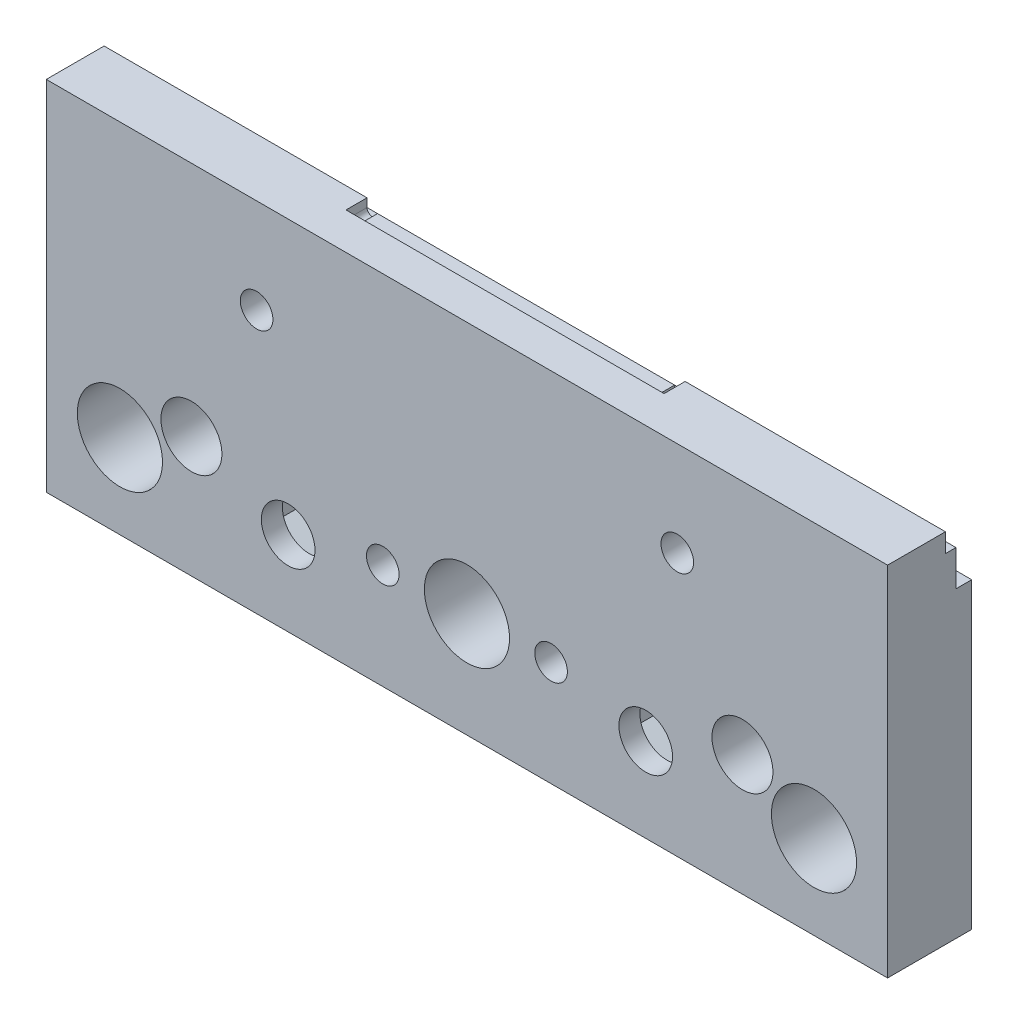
ISO-10303-21;
HEADER;
FILE_DESCRIPTION(('STEP AP214'),'2;1');
FILE_NAME('part.step','',(''),(''),'','','');
FILE_SCHEMA(('AUTOMOTIVE_DESIGN { 1 0 10303 214 1 1 1 1 }'));
ENDSEC;
DATA;
#1=APPLICATION_CONTEXT('core data for automotive mechanical design processes');
#2=APPLICATION_PROTOCOL_DEFINITION('international standard','automotive_design',2000,#1);
#3=PRODUCT_CONTEXT('',#1,'mechanical');
#4=PRODUCT('Part','Part','',(#3));
#5=PRODUCT_RELATED_PRODUCT_CATEGORY('part','',(#4));
#6=PRODUCT_DEFINITION_FORMATION('','',#4);
#7=PRODUCT_DEFINITION_CONTEXT('part definition',#1,'design');
#8=PRODUCT_DEFINITION('design','',#6,#7);
#9=PRODUCT_DEFINITION_SHAPE('','',#8);
#10=(LENGTH_UNIT() NAMED_UNIT(*) SI_UNIT(.MILLI.,.METRE.));
#11=(NAMED_UNIT(*) PLANE_ANGLE_UNIT() SI_UNIT($,.RADIAN.));
#12=(NAMED_UNIT(*) SI_UNIT($,.STERADIAN.) SOLID_ANGLE_UNIT());
#13=UNCERTAINTY_MEASURE_WITH_UNIT(LENGTH_MEASURE(1.E-05),#10,'distance_accuracy_value','');
#14=(GEOMETRIC_REPRESENTATION_CONTEXT(3) GLOBAL_UNCERTAINTY_ASSIGNED_CONTEXT((#13)) GLOBAL_UNIT_ASSIGNED_CONTEXT((#10,
#11,#12)) REPRESENTATION_CONTEXT('',''));
#15=CARTESIAN_POINT('',(0.,0.,0.));
#16=DIRECTION('',(0.,0.,1.));
#17=DIRECTION('',(1.,0.,0.));
#18=AXIS2_PLACEMENT_3D('',#15,#16,#17);
#19=CARTESIAN_POINT('',(57.,8.,0.));
#20=DIRECTION('',(0.,0.,1.));
#21=DIRECTION('',(1.,0.,0.));
#22=AXIS2_PLACEMENT_3D('',#19,#20,#21);
#23=CYLINDRICAL_SURFACE('',#22,2.55);
#24=CARTESIAN_POINT('',(57.,8.,8.));
#25=DIRECTION('',(0.,0.,1.));
#26=DIRECTION('',(1.,0.,0.));
#27=AXIS2_PLACEMENT_3D('',#24,#25,#26);
#28=CIRCLE('',#27,2.55);
#29=CARTESIAN_POINT('',(59.55,8.,8.));
#30=VERTEX_POINT('',#29);
#31=EDGE_CURVE('E582',#30,#30,#28,.T.);
#32=ORIENTED_EDGE('',*,*,#31,.T.);
#33=EDGE_LOOP('',(#32));
#34=FACE_BOUND('',#33,.T.);
#35=CARTESIAN_POINT('',(57.,8.,6.));
#36=DIRECTION('',(0.,0.,-1.));
#37=DIRECTION('',(-1.,0.,0.));
#38=AXIS2_PLACEMENT_3D('',#35,#36,#37);
#39=CIRCLE('',#38,2.55);
#40=CARTESIAN_POINT('',(54.45,8.,6.));
#41=VERTEX_POINT('',#40);
#42=EDGE_CURVE('E37',#41,#41,#39,.F.);
#43=ORIENTED_EDGE('',*,*,#42,.F.);
#44=EDGE_LOOP('',(#43));
#45=FACE_BOUND('',#44,.T.);
#46=ADVANCED_FACE('F33',(#34,#45),#23,.F.);
#47=CARTESIAN_POINT('',(23.,8.,0.));
#48=DIRECTION('',(0.,0.,1.));
#49=DIRECTION('',(1.,0.,0.));
#50=AXIS2_PLACEMENT_3D('',#47,#48,#49);
#51=CYLINDRICAL_SURFACE('',#50,2.55);
#52=CARTESIAN_POINT('',(23.,8.,8.));
#53=DIRECTION('',(0.,0.,1.));
#54=DIRECTION('',(1.,0.,0.));
#55=AXIS2_PLACEMENT_3D('',#52,#53,#54);
#56=CIRCLE('',#55,2.55);
#57=CARTESIAN_POINT('',(25.55,8.,8.));
#58=VERTEX_POINT('',#57);
#59=EDGE_CURVE('E592',#58,#58,#56,.T.);
#60=ORIENTED_EDGE('',*,*,#59,.T.);
#61=EDGE_LOOP('',(#60));
#62=FACE_BOUND('',#61,.T.);
#63=CARTESIAN_POINT('',(23.,8.,6.));
#64=DIRECTION('',(0.,0.,-1.));
#65=DIRECTION('',(-1.,0.,0.));
#66=AXIS2_PLACEMENT_3D('',#63,#64,#65);
#67=CIRCLE('',#66,2.55);
#68=CARTESIAN_POINT('',(20.45,8.,6.));
#69=VERTEX_POINT('',#68);
#70=EDGE_CURVE('E329',#69,#69,#67,.F.);
#71=ORIENTED_EDGE('',*,*,#70,.F.);
#72=EDGE_LOOP('',(#71));
#73=FACE_BOUND('',#72,.T.);
#74=ADVANCED_FACE('F649',(#62,#73),#51,.F.);
#75=CARTESIAN_POINT('',(32.,10.,0.));
#76=DIRECTION('',(0.,0.,1.));
#77=DIRECTION('',(1.,0.,0.));
#78=AXIS2_PLACEMENT_3D('',#75,#76,#77);
#79=CYLINDRICAL_SURFACE('',#78,1.55);
#80=CARTESIAN_POINT('',(32.,10.,8.));
#81=DIRECTION('',(0.,0.,1.));
#82=DIRECTION('',(1.,0.,0.));
#83=AXIS2_PLACEMENT_3D('',#80,#81,#82);
#84=CIRCLE('',#83,1.55);
#85=CARTESIAN_POINT('',(33.55,10.,8.));
#86=VERTEX_POINT('',#85);
#87=EDGE_CURVE('E552',#86,#86,#84,.T.);
#88=ORIENTED_EDGE('',*,*,#87,.T.);
#89=EDGE_LOOP('',(#88));
#90=FACE_BOUND('',#89,.T.);
#91=CARTESIAN_POINT('',(32.,10.,4.5));
#92=DIRECTION('',(0.,0.,-1.));
#93=DIRECTION('',(-1.,0.,0.));
#94=AXIS2_PLACEMENT_3D('',#91,#92,#93);
#95=CIRCLE('',#94,1.55);
#96=CARTESIAN_POINT('',(30.45,10.,4.5));
#97=VERTEX_POINT('',#96);
#98=EDGE_CURVE('E555',#97,#97,#95,.F.);
#99=ORIENTED_EDGE('',*,*,#98,.F.);
#100=EDGE_LOOP('',(#99));
#101=FACE_BOUND('',#100,.T.);
#102=ADVANCED_FACE('F655',(#90,#101),#79,.F.);
#103=CARTESIAN_POINT('',(48.,10.,0.));
#104=DIRECTION('',(0.,0.,1.));
#105=DIRECTION('',(1.,0.,0.));
#106=AXIS2_PLACEMENT_3D('',#103,#104,#105);
#107=CYLINDRICAL_SURFACE('',#106,1.55);
#108=CARTESIAN_POINT('',(48.,10.,8.));
#109=DIRECTION('',(0.,0.,1.));
#110=DIRECTION('',(1.,0.,0.));
#111=AXIS2_PLACEMENT_3D('',#108,#109,#110);
#112=CIRCLE('',#111,1.55);
#113=CARTESIAN_POINT('',(49.55,10.,8.));
#114=VERTEX_POINT('',#113);
#115=EDGE_CURVE('E548',#114,#114,#112,.T.);
#116=ORIENTED_EDGE('',*,*,#115,.T.);
#117=EDGE_LOOP('',(#116));
#118=FACE_BOUND('',#117,.T.);
#119=CARTESIAN_POINT('',(48.,10.,4.5));
#120=DIRECTION('',(0.,0.,-1.));
#121=DIRECTION('',(-1.,0.,0.));
#122=AXIS2_PLACEMENT_3D('',#119,#120,#121);
#123=CIRCLE('',#122,1.55);
#124=CARTESIAN_POINT('',(46.45,10.,4.5));
#125=VERTEX_POINT('',#124);
#126=EDGE_CURVE('E491',#125,#125,#123,.F.);
#127=ORIENTED_EDGE('',*,*,#126,.F.);
#128=EDGE_LOOP('',(#127));
#129=FACE_BOUND('',#128,.T.);
#130=ADVANCED_FACE('F678',(#118,#129),#107,.F.);
#131=CARTESIAN_POINT('',(0.,0.,8.));
#132=DIRECTION('',(0.,0.,1.));
#133=DIRECTION('',(1.,0.,0.));
#134=AXIS2_PLACEMENT_3D('',#131,#132,#133);
#135=PLANE('',#134);
#136=CARTESIAN_POINT('',(66.2,11.4999999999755,8.));
#137=DIRECTION('',(0.,0.,-1.));
#138=DIRECTION('',(-1.,0.,0.));
#139=AXIS2_PLACEMENT_3D('',#136,#137,#138);
#140=CIRCLE('',#139,2.9);
#141=CARTESIAN_POINT('',(63.3,11.4999999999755,8.));
#142=VERTEX_POINT('',#141);
#143=EDGE_CURVE('E382',#142,#142,#140,.T.);
#144=ORIENTED_EDGE('',*,*,#143,.T.);
#145=EDGE_LOOP('',(#144));
#146=FACE_BOUND('',#145,.T.);
#147=CARTESIAN_POINT('',(13.8,11.4999999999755,8.));
#148=DIRECTION('',(0.,0.,-1.));
#149=DIRECTION('',(1.,0.,0.));
#150=AXIS2_PLACEMENT_3D('',#147,#148,#149);
#151=CIRCLE('',#150,2.9);
#152=CARTESIAN_POINT('',(16.7,11.4999999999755,8.));
#153=VERTEX_POINT('',#152);
#154=EDGE_CURVE('E389',#153,#153,#151,.T.);
#155=ORIENTED_EDGE('',*,*,#154,.T.);
#156=EDGE_LOOP('',(#155));
#157=FACE_BOUND('',#156,.T.);
#158=CARTESIAN_POINT('',(60.,25.,8.));
#159=DIRECTION('',(0.,0.,-1.));
#160=DIRECTION('',(-1.,0.,0.));
#161=AXIS2_PLACEMENT_3D('',#158,#159,#160);
#162=CIRCLE('',#161,1.55000000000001);
#163=CARTESIAN_POINT('',(58.45,25.,8.));
#164=VERTEX_POINT('',#163);
#165=EDGE_CURVE('E440',#164,#164,#162,.T.);
#166=ORIENTED_EDGE('',*,*,#165,.T.);
#167=EDGE_LOOP('',(#166));
#168=FACE_BOUND('',#167,.T.);
#169=CARTESIAN_POINT('',(20.,25.,8.));
#170=DIRECTION('',(0.,0.,-1.));
#171=DIRECTION('',(-1.,0.,0.));
#172=AXIS2_PLACEMENT_3D('',#169,#170,#171);
#173=CIRCLE('',#172,1.55);
#174=CARTESIAN_POINT('',(18.45,25.,8.));
#175=VERTEX_POINT('',#174);
#176=EDGE_CURVE('E447',#175,#175,#173,.T.);
#177=ORIENTED_EDGE('',*,*,#176,.T.);
#178=EDGE_LOOP('',(#177));
#179=FACE_BOUND('',#178,.T.);
#180=ORIENTED_EDGE('',*,*,#115,.F.);
#181=EDGE_LOOP('',(#180));
#182=FACE_BOUND('',#181,.T.);
#183=ORIENTED_EDGE('',*,*,#87,.F.);
#184=EDGE_LOOP('',(#183));
#185=FACE_BOUND('',#184,.T.);
#186=ORIENTED_EDGE('',*,*,#59,.F.);
#187=EDGE_LOOP('',(#186));
#188=FACE_BOUND('',#187,.T.);
#189=ORIENTED_EDGE('',*,*,#31,.F.);
#190=EDGE_LOOP('',(#189));
#191=FACE_BOUND('',#190,.T.);
#192=CARTESIAN_POINT('',(40.,10.,8.));
#193=DIRECTION('',(0.,0.,1.));
#194=DIRECTION('',(1.,0.,0.));
#195=AXIS2_PLACEMENT_3D('',#192,#193,#194);
#196=CIRCLE('',#195,4.05);
#197=CARTESIAN_POINT('',(44.05,10.,8.));
#198=VERTEX_POINT('',#197);
#199=EDGE_CURVE('E604',#198,#198,#196,.T.);
#200=ORIENTED_EDGE('',*,*,#199,.F.);
#201=EDGE_LOOP('',(#200));
#202=FACE_BOUND('',#201,.T.);
#203=DIRECTION('',(0.,-1.,0.));
#204=VECTOR('',#203,1.);
#205=CARTESIAN_POINT('',(0.,34.,8.));
#206=LINE('',#205,#204);
#207=CARTESIAN_POINT('',(0.,34.,8.));
#208=VERTEX_POINT('',#207);
#209=CARTESIAN_POINT('',(0.,0.,8.));
#210=VERTEX_POINT('',#209);
#211=EDGE_CURVE('E616',#208,#210,#206,.T.);
#212=ORIENTED_EDGE('',*,*,#211,.T.);
#213=DIRECTION('',(1.,0.,0.));
#214=VECTOR('',#213,1.);
#215=CARTESIAN_POINT('',(0.,0.,8.));
#216=LINE('',#215,#214);
#217=CARTESIAN_POINT('',(80.,0.,8.));
#218=VERTEX_POINT('',#217);
#219=EDGE_CURVE('E619',#210,#218,#216,.T.);
#220=ORIENTED_EDGE('',*,*,#219,.T.);
#221=DIRECTION('',(0.,1.,0.));
#222=VECTOR('',#221,1.);
#223=CARTESIAN_POINT('',(80.,0.,8.));
#224=LINE('',#223,#222);
#225=CARTESIAN_POINT('',(80.,34.,8.));
#226=VERTEX_POINT('',#225);
#227=EDGE_CURVE('E622',#218,#226,#224,.T.);
#228=ORIENTED_EDGE('',*,*,#227,.T.);
#229=DIRECTION('',(-1.,0.,0.));
#230=VECTOR('',#229,1.);
#231=CARTESIAN_POINT('',(80.,34.,8.));
#232=LINE('',#231,#230);
#233=EDGE_CURVE('E624',#226,#208,#232,.T.);
#234=ORIENTED_EDGE('',*,*,#233,.T.);
#235=EDGE_LOOP('',(#212,#220,#228,#234));
#236=FACE_BOUND('',#235,.T.);
#237=CARTESIAN_POINT('',(7.,8.,8.));
#238=DIRECTION('',(0.,0.,1.));
#239=DIRECTION('',(1.,0.,0.));
#240=AXIS2_PLACEMENT_3D('',#237,#238,#239);
#241=CIRCLE('',#240,4.05);
#242=CARTESIAN_POINT('',(11.05,8.,8.));
#243=VERTEX_POINT('',#242);
#244=EDGE_CURVE('E610',#243,#243,#241,.T.);
#245=ORIENTED_EDGE('',*,*,#244,.F.);
#246=EDGE_LOOP('',(#245));
#247=FACE_BOUND('',#246,.T.);
#248=CARTESIAN_POINT('',(73.,8.,8.));
#249=DIRECTION('',(0.,0.,1.));
#250=DIRECTION('',(1.,0.,0.));
#251=AXIS2_PLACEMENT_3D('',#248,#249,#250);
#252=CIRCLE('',#251,4.05);
#253=CARTESIAN_POINT('',(77.05,8.,8.));
#254=VERTEX_POINT('',#253);
#255=EDGE_CURVE('E598',#254,#254,#252,.T.);
#256=ORIENTED_EDGE('',*,*,#255,.F.);
#257=EDGE_LOOP('',(#256));
#258=FACE_BOUND('',#257,.T.);
#259=ADVANCED_FACE('F674',(#146,#157,#168,#179,#182,#185,#188,#191,#202,#236,#247,#258),#135,.T.);
#260=CARTESIAN_POINT('',(0.,0.,0.));
#261=DIRECTION('',(0.,0.,1.));
#262=DIRECTION('',(1.,0.,0.));
#263=AXIS2_PLACEMENT_3D('',#260,#261,#262);
#264=PLANE('',#263);
#265=DIRECTION('',(0.,1.,0.));
#266=VECTOR('',#265,1.);
#267=CARTESIAN_POINT('',(52.9,5.63286389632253,0.));
#268=LINE('',#267,#266);
#269=CARTESIAN_POINT('',(52.9,5.63286389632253,0.));
#270=VERTEX_POINT('',#269);
#271=CARTESIAN_POINT('',(52.9,10.3671361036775,0.));
#272=VERTEX_POINT('',#271);
#273=EDGE_CURVE('E316',#270,#272,#268,.T.);
#274=ORIENTED_EDGE('',*,*,#273,.F.);
#275=DIRECTION('',(-0.866025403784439,0.5,0.));
#276=VECTOR('',#275,1.);
#277=CARTESIAN_POINT('',(57.,3.26572779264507,0.));
#278=LINE('',#277,#276);
#279=CARTESIAN_POINT('',(57.,3.26572779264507,0.));
#280=VERTEX_POINT('',#279);
#281=EDGE_CURVE('E50',#280,#270,#278,.T.);
#282=ORIENTED_EDGE('',*,*,#281,.F.);
#283=DIRECTION('',(-0.866025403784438,-0.5,0.));
#284=VECTOR('',#283,1.);
#285=CARTESIAN_POINT('',(61.1,5.63286389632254,0.));
#286=LINE('',#285,#284);
#287=CARTESIAN_POINT('',(61.1,5.63286389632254,0.));
#288=VERTEX_POINT('',#287);
#289=EDGE_CURVE('E302',#288,#280,#286,.T.);
#290=ORIENTED_EDGE('',*,*,#289,.F.);
#291=DIRECTION('',(0.,-1.,0.));
#292=VECTOR('',#291,1.);
#293=CARTESIAN_POINT('',(61.1,10.3671361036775,0.));
#294=LINE('',#293,#292);
#295=CARTESIAN_POINT('',(61.1,10.3671361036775,0.));
#296=VERTEX_POINT('',#295);
#297=EDGE_CURVE('E305',#296,#288,#294,.T.);
#298=ORIENTED_EDGE('',*,*,#297,.F.);
#299=DIRECTION('',(0.866025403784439,-0.5,0.));
#300=VECTOR('',#299,1.);
#301=CARTESIAN_POINT('',(57.,12.7342722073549,0.));
#302=LINE('',#301,#300);
#303=CARTESIAN_POINT('',(57.,12.7342722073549,0.));
#304=VERTEX_POINT('',#303);
#305=EDGE_CURVE('E322',#304,#296,#302,.T.);
#306=ORIENTED_EDGE('',*,*,#305,.F.);
#307=DIRECTION('',(0.866025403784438,0.5,0.));
#308=VECTOR('',#307,1.);
#309=CARTESIAN_POINT('',(52.9,10.3671361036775,0.));
#310=LINE('',#309,#308);
#311=EDGE_CURVE('E319',#272,#304,#310,.T.);
#312=ORIENTED_EDGE('',*,*,#311,.F.);
#313=EDGE_LOOP('',(#274,#282,#290,#298,#306,#312));
#314=FACE_BOUND('',#313,.T.);
#315=DIRECTION('',(-0.866025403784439,0.499999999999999,0.));
#316=VECTOR('',#315,1.);
#317=CARTESIAN_POINT('',(23.,3.26572779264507,0.));
#318=LINE('',#317,#316);
#319=CARTESIAN_POINT('',(23.,3.26572779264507,0.));
#320=VERTEX_POINT('',#319);
#321=CARTESIAN_POINT('',(18.9,5.63286389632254,0.));
#322=VERTEX_POINT('',#321);
#323=EDGE_CURVE('E358',#320,#322,#318,.T.);
#324=ORIENTED_EDGE('',*,*,#323,.F.);
#325=DIRECTION('',(-0.866025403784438,-0.500000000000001,0.));
#326=VECTOR('',#325,1.);
#327=CARTESIAN_POINT('',(27.1,5.63286389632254,0.));
#328=LINE('',#327,#326);
#329=CARTESIAN_POINT('',(27.1,5.63286389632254,0.));
#330=VERTEX_POINT('',#329);
#331=EDGE_CURVE('E58',#330,#320,#328,.T.);
#332=ORIENTED_EDGE('',*,*,#331,.F.);
#333=DIRECTION('',(0.,-1.,0.));
#334=VECTOR('',#333,1.);
#335=CARTESIAN_POINT('',(27.1,10.3671361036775,0.));
#336=LINE('',#335,#334);
#337=CARTESIAN_POINT('',(27.1,10.3671361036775,0.));
#338=VERTEX_POINT('',#337);
#339=EDGE_CURVE('E341',#338,#330,#336,.T.);
#340=ORIENTED_EDGE('',*,*,#339,.F.);
#341=DIRECTION('',(0.866025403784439,-0.5,0.));
#342=VECTOR('',#341,1.);
#343=CARTESIAN_POINT('',(23.,12.7342722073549,0.));
#344=LINE('',#343,#342);
#345=CARTESIAN_POINT('',(23.,12.7342722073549,0.));
#346=VERTEX_POINT('',#345);
#347=EDGE_CURVE('E367',#346,#338,#344,.T.);
#348=ORIENTED_EDGE('',*,*,#347,.F.);
#349=DIRECTION('',(0.866025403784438,0.5,0.));
#350=VECTOR('',#349,1.);
#351=CARTESIAN_POINT('',(18.9,10.3671361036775,0.));
#352=LINE('',#351,#350);
#353=CARTESIAN_POINT('',(18.9,10.3671361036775,0.));
#354=VERTEX_POINT('',#353);
#355=EDGE_CURVE('E364',#354,#346,#352,.T.);
#356=ORIENTED_EDGE('',*,*,#355,.F.);
#357=DIRECTION('',(0.,1.,0.));
#358=VECTOR('',#357,1.);
#359=CARTESIAN_POINT('',(18.9,5.63286389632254,0.));
#360=LINE('',#359,#358);
#361=EDGE_CURVE('E361',#322,#354,#360,.T.);
#362=ORIENTED_EDGE('',*,*,#361,.F.);
#363=EDGE_LOOP('',(#324,#332,#340,#348,#356,#362));
#364=FACE_BOUND('',#363,.T.);
#365=CARTESIAN_POINT('',(66.2,11.4999999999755,0.));
#366=DIRECTION('',(0.,0.,-1.));
#367=DIRECTION('',(-1.,0.,0.));
#368=AXIS2_PLACEMENT_3D('',#365,#366,#367);
#369=CIRCLE('',#368,2.9);
#370=CARTESIAN_POINT('',(63.3,11.4999999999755,0.));
#371=VERTEX_POINT('',#370);
#372=EDGE_CURVE('E386',#371,#371,#369,.T.);
#373=ORIENTED_EDGE('',*,*,#372,.F.);
#374=EDGE_LOOP('',(#373));
#375=FACE_BOUND('',#374,.T.);
#376=CARTESIAN_POINT('',(13.8,11.4999999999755,0.));
#377=DIRECTION('',(0.,0.,-1.));
#378=DIRECTION('',(1.,0.,0.));
#379=AXIS2_PLACEMENT_3D('',#376,#377,#378);
#380=CIRCLE('',#379,2.9);
#381=CARTESIAN_POINT('',(16.7,11.4999999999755,0.));
#382=VERTEX_POINT('',#381);
#383=EDGE_CURVE('E392',#382,#382,#380,.T.);
#384=ORIENTED_EDGE('',*,*,#383,.F.);
#385=EDGE_LOOP('',(#384));
#386=FACE_BOUND('',#385,.T.);
#387=CARTESIAN_POINT('',(60.,25.,0.));
#388=DIRECTION('',(0.,0.,-1.));
#389=DIRECTION('',(-1.,0.,0.));
#390=AXIS2_PLACEMENT_3D('',#387,#388,#389);
#391=CIRCLE('',#390,1.55000000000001);
#392=CARTESIAN_POINT('',(58.45,25.,0.));
#393=VERTEX_POINT('',#392);
#394=EDGE_CURVE('E444',#393,#393,#391,.T.);
#395=ORIENTED_EDGE('',*,*,#394,.F.);
#396=EDGE_LOOP('',(#395));
#397=FACE_BOUND('',#396,.T.);
#398=CARTESIAN_POINT('',(20.,25.,0.));
#399=DIRECTION('',(0.,0.,-1.));
#400=DIRECTION('',(-1.,0.,0.));
#401=AXIS2_PLACEMENT_3D('',#398,#399,#400);
#402=CIRCLE('',#401,1.55);
#403=CARTESIAN_POINT('',(18.45,25.,0.));
#404=VERTEX_POINT('',#403);
#405=EDGE_CURVE('E429',#404,#404,#402,.T.);
#406=ORIENTED_EDGE('',*,*,#405,.F.);
#407=EDGE_LOOP('',(#406));
#408=FACE_BOUND('',#407,.T.);
#409=DIRECTION('',(0.,-1.,0.));
#410=VECTOR('',#409,1.);
#411=CARTESIAN_POINT('',(50.85,11.6454482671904,0.));
#412=LINE('',#411,#410);
#413=CARTESIAN_POINT('',(50.85,11.6454482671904,0.));
#414=VERTEX_POINT('',#413);
#415=CARTESIAN_POINT('',(50.85,8.35455173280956,0.));
#416=VERTEX_POINT('',#415);
#417=EDGE_CURVE('E474',#414,#416,#412,.T.);
#418=ORIENTED_EDGE('',*,*,#417,.F.);
#419=DIRECTION('',(0.866025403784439,-0.499999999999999,0.));
#420=VECTOR('',#419,1.);
#421=CARTESIAN_POINT('',(48.,13.2908965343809,0.));
#422=LINE('',#421,#420);
#423=CARTESIAN_POINT('',(48.,13.2908965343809,0.));
#424=VERTEX_POINT('',#423);
#425=EDGE_CURVE('E472',#424,#414,#422,.T.);
#426=ORIENTED_EDGE('',*,*,#425,.F.);
#427=DIRECTION('',(0.866025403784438,0.500000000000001,0.));
#428=VECTOR('',#427,1.);
#429=CARTESIAN_POINT('',(45.15,11.6454482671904,0.));
#430=LINE('',#429,#428);
#431=CARTESIAN_POINT('',(45.15,11.6454482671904,0.));
#432=VERTEX_POINT('',#431);
#433=EDGE_CURVE('E456',#432,#424,#430,.T.);
#434=ORIENTED_EDGE('',*,*,#433,.F.);
#435=DIRECTION('',(0.,1.,0.));
#436=VECTOR('',#435,1.);
#437=CARTESIAN_POINT('',(45.15,8.35455173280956,0.));
#438=LINE('',#437,#436);
#439=CARTESIAN_POINT('',(45.15,8.35455173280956,0.));
#440=VERTEX_POINT('',#439);
#441=EDGE_CURVE('E484',#440,#432,#438,.T.);
#442=ORIENTED_EDGE('',*,*,#441,.F.);
#443=DIRECTION('',(-0.866025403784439,0.499999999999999,0.));
#444=VECTOR('',#443,1.);
#445=CARTESIAN_POINT('',(48.,6.70910346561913,0.));
#446=LINE('',#445,#444);
#447=CARTESIAN_POINT('',(48.,6.70910346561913,0.));
#448=VERTEX_POINT('',#447);
#449=EDGE_CURVE('E481',#448,#440,#446,.T.);
#450=ORIENTED_EDGE('',*,*,#449,.F.);
#451=DIRECTION('',(-0.866025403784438,-0.5,0.));
#452=VECTOR('',#451,1.);
#453=CARTESIAN_POINT('',(50.85,8.35455173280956,0.));
#454=LINE('',#453,#452);
#455=EDGE_CURVE('E478',#416,#448,#454,.T.);
#456=ORIENTED_EDGE('',*,*,#455,.F.);
#457=EDGE_LOOP('',(#418,#426,#434,#442,#450,#456));
#458=FACE_BOUND('',#457,.T.);
#459=DIRECTION('',(-0.866025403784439,-0.499999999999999,0.));
#460=VECTOR('',#459,1.);
#461=CARTESIAN_POINT('',(34.85,8.35455173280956,0.));
#462=LINE('',#461,#460);
#463=CARTESIAN_POINT('',(34.85,8.35455173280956,0.));
#464=VERTEX_POINT('',#463);
#465=CARTESIAN_POINT('',(32.,6.70910346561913,0.));
#466=VERTEX_POINT('',#465);
#467=EDGE_CURVE('E528',#464,#466,#462,.T.);
#468=ORIENTED_EDGE('',*,*,#467,.F.);
#469=DIRECTION('',(0.,-1.,0.));
#470=VECTOR('',#469,1.);
#471=CARTESIAN_POINT('',(34.85,11.6454482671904,0.));
#472=LINE('',#471,#470);
#473=CARTESIAN_POINT('',(34.85,11.6454482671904,0.));
#474=VERTEX_POINT('',#473);
#475=EDGE_CURVE('E475',#474,#464,#472,.T.);
#476=ORIENTED_EDGE('',*,*,#475,.F.);
#477=DIRECTION('',(0.866025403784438,-0.500000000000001,0.));
#478=VECTOR('',#477,1.);
#479=CARTESIAN_POINT('',(32.,13.2908965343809,0.));
#480=LINE('',#479,#478);
#481=CARTESIAN_POINT('',(32.,13.2908965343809,0.));
#482=VERTEX_POINT('',#481);
#483=EDGE_CURVE('E515',#482,#474,#480,.T.);
#484=ORIENTED_EDGE('',*,*,#483,.F.);
#485=DIRECTION('',(0.866025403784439,0.499999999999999,0.));
#486=VECTOR('',#485,1.);
#487=CARTESIAN_POINT('',(29.15,11.6454482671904,0.));
#488=LINE('',#487,#486);
#489=CARTESIAN_POINT('',(29.15,11.6454482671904,0.));
#490=VERTEX_POINT('',#489);
#491=EDGE_CURVE('E518',#490,#482,#488,.T.);
#492=ORIENTED_EDGE('',*,*,#491,.F.);
#493=DIRECTION('',(0.,1.,0.));
#494=VECTOR('',#493,1.);
#495=CARTESIAN_POINT('',(29.15,8.35455173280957,0.));
#496=LINE('',#495,#494);
#497=CARTESIAN_POINT('',(29.15,8.35455173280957,0.));
#498=VERTEX_POINT('',#497);
#499=EDGE_CURVE('E522',#498,#490,#496,.T.);
#500=ORIENTED_EDGE('',*,*,#499,.F.);
#501=DIRECTION('',(-0.866025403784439,0.5,0.));
#502=VECTOR('',#501,1.);
#503=CARTESIAN_POINT('',(32.,6.70910346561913,0.));
#504=LINE('',#503,#502);
#505=EDGE_CURVE('E525',#466,#498,#504,.T.);
#506=ORIENTED_EDGE('',*,*,#505,.F.);
#507=EDGE_LOOP('',(#468,#476,#484,#492,#500,#506));
#508=FACE_BOUND('',#507,.T.);
#509=DIRECTION('',(0.,-1.,0.));
#510=VECTOR('',#509,1.);
#511=CARTESIAN_POINT('',(0.,34.,0.));
#512=LINE('',#511,#510);
#513=CARTESIAN_POINT('',(0.,28.7999999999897,0.));
#514=VERTEX_POINT('',#513);
#515=CARTESIAN_POINT('',(0.,0.,0.));
#516=VERTEX_POINT('',#515);
#517=EDGE_CURVE('E613',#514,#516,#512,.T.);
#518=ORIENTED_EDGE('',*,*,#517,.F.);
#519=DIRECTION('',(1.,0.,0.));
#520=VECTOR('',#519,1.);
#521=CARTESIAN_POINT('',(0.,28.7999999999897,0.));
#522=LINE('',#521,#520);
#523=CARTESIAN_POINT('',(80.,28.7999999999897,0.));
#524=VERTEX_POINT('',#523);
#525=EDGE_CURVE('E579',#514,#524,#522,.T.);
#526=ORIENTED_EDGE('',*,*,#525,.T.);
#527=DIRECTION('',(0.,1.,0.));
#528=VECTOR('',#527,1.);
#529=CARTESIAN_POINT('',(80.,0.,0.));
#530=LINE('',#529,#528);
#531=CARTESIAN_POINT('',(80.,0.,0.));
#532=VERTEX_POINT('',#531);
#533=EDGE_CURVE('E620',#532,#524,#530,.T.);
#534=ORIENTED_EDGE('',*,*,#533,.F.);
#535=DIRECTION('',(1.,0.,0.));
#536=VECTOR('',#535,1.);
#537=CARTESIAN_POINT('',(0.,0.,0.));
#538=LINE('',#537,#536);
#539=EDGE_CURVE('E628',#516,#532,#538,.T.);
#540=ORIENTED_EDGE('',*,*,#539,.F.);
#541=EDGE_LOOP('',(#518,#526,#534,#540));
#542=FACE_BOUND('',#541,.T.);
#543=CARTESIAN_POINT('',(7.,8.,0.));
#544=DIRECTION('',(0.,0.,1.));
#545=DIRECTION('',(1.,0.,0.));
#546=AXIS2_PLACEMENT_3D('',#543,#544,#545);
#547=CIRCLE('',#546,4.05);
#548=CARTESIAN_POINT('',(11.05,8.,0.));
#549=VERTEX_POINT('',#548);
#550=EDGE_CURVE('E607',#549,#549,#547,.T.);
#551=ORIENTED_EDGE('',*,*,#550,.T.);
#552=EDGE_LOOP('',(#551));
#553=FACE_BOUND('',#552,.T.);
#554=CARTESIAN_POINT('',(40.,10.,0.));
#555=DIRECTION('',(0.,0.,1.));
#556=DIRECTION('',(1.,0.,0.));
#557=AXIS2_PLACEMENT_3D('',#554,#555,#556);
#558=CIRCLE('',#557,4.05);
#559=CARTESIAN_POINT('',(44.05,10.,0.));
#560=VERTEX_POINT('',#559);
#561=EDGE_CURVE('E601',#560,#560,#558,.T.);
#562=ORIENTED_EDGE('',*,*,#561,.T.);
#563=EDGE_LOOP('',(#562));
#564=FACE_BOUND('',#563,.T.);
#565=CARTESIAN_POINT('',(73.,8.,0.));
#566=DIRECTION('',(0.,0.,1.));
#567=DIRECTION('',(1.,0.,0.));
#568=AXIS2_PLACEMENT_3D('',#565,#566,#567);
#569=CIRCLE('',#568,4.05);
#570=CARTESIAN_POINT('',(77.05,8.,0.));
#571=VERTEX_POINT('',#570);
#572=EDGE_CURVE('E595',#571,#571,#569,.T.);
#573=ORIENTED_EDGE('',*,*,#572,.T.);
#574=EDGE_LOOP('',(#573));
#575=FACE_BOUND('',#574,.T.);
#576=ADVANCED_FACE('F677',(#314,#364,#375,#386,#397,#408,#458,#508,#542,#553,#564,#575),#264,.F.);
#577=CARTESIAN_POINT('',(0.,34.,8.));
#578=DIRECTION('',(1.,0.,0.));
#579=DIRECTION('',(0.,0.,-1.));
#580=AXIS2_PLACEMENT_3D('',#577,#578,#579);
#581=PLANE('',#580);
#582=DIRECTION('',(0.,-1.,0.));
#583=VECTOR('',#582,1.);
#584=CARTESIAN_POINT('',(0.,32.2,1.5));
#585=LINE('',#584,#583);
#586=CARTESIAN_POINT('',(0.,32.2,1.5));
#587=VERTEX_POINT('',#586);
#588=CARTESIAN_POINT('',(0.,28.8,1.5));
#589=VERTEX_POINT('',#588);
#590=EDGE_CURVE('E563',#587,#589,#585,.T.);
#591=ORIENTED_EDGE('',*,*,#590,.T.);
#592=DIRECTION('',(0.,-6.85562717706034E-12,-1.));
#593=VECTOR('',#592,1.);
#594=CARTESIAN_POINT('',(0.,28.8,1.5));
#595=LINE('',#594,#593);
#596=EDGE_CURVE('E566',#589,#514,#595,.T.);
#597=ORIENTED_EDGE('',*,*,#596,.T.);
#598=ORIENTED_EDGE('',*,*,#517,.T.);
#599=DIRECTION('',(0.,0.,-1.));
#600=VECTOR('',#599,1.);
#601=CARTESIAN_POINT('',(0.,0.,8.));
#602=LINE('',#601,#600);
#603=EDGE_CURVE('E11',#210,#516,#602,.T.);
#604=ORIENTED_EDGE('',*,*,#603,.F.);
#605=ORIENTED_EDGE('',*,*,#211,.F.);
#606=DIRECTION('',(0.,0.,-1.));
#607=VECTOR('',#606,1.);
#608=CARTESIAN_POINT('',(0.,34.,8.));
#609=LINE('',#608,#607);
#610=CARTESIAN_POINT('',(0.,34.,2.5));
#611=VERTEX_POINT('',#610);
#612=EDGE_CURVE('E626',#208,#611,#609,.T.);
#613=ORIENTED_EDGE('',*,*,#612,.T.);
#614=DIRECTION('',(0.,-1.,0.));
#615=VECTOR('',#614,1.);
#616=CARTESIAN_POINT('',(0.,32.2,2.5));
#617=LINE('',#616,#615);
#618=CARTESIAN_POINT('',(0.,32.2,2.5));
#619=VERTEX_POINT('',#618);
#620=EDGE_CURVE('E556',#611,#619,#617,.T.);
#621=ORIENTED_EDGE('',*,*,#620,.T.);
#622=DIRECTION('',(0.,0.,-1.));
#623=VECTOR('',#622,1.);
#624=CARTESIAN_POINT('',(0.,32.2,1.5));
#625=LINE('',#624,#623);
#626=EDGE_CURVE('E559',#619,#587,#625,.T.);
#627=ORIENTED_EDGE('',*,*,#626,.T.);
#628=EDGE_LOOP('',(#591,#597,#598,#604,#605,#613,#621,#627));
#629=FACE_BOUND('',#628,.T.);
#630=ADVANCED_FACE('F35',(#629),#581,.F.);
#631=CARTESIAN_POINT('',(0.,0.,8.));
#632=DIRECTION('',(0.,1.,0.));
#633=DIRECTION('',(0.,0.,1.));
#634=AXIS2_PLACEMENT_3D('',#631,#632,#633);
#635=PLANE('',#634);
#636=ORIENTED_EDGE('',*,*,#539,.T.);
#637=DIRECTION('',(0.,0.,-1.));
#638=VECTOR('',#637,1.);
#639=CARTESIAN_POINT('',(80.,0.,8.));
#640=LINE('',#639,#638);
#641=EDGE_CURVE('E42',#218,#532,#640,.T.);
#642=ORIENTED_EDGE('',*,*,#641,.F.);
#643=ORIENTED_EDGE('',*,*,#219,.F.);
#644=ORIENTED_EDGE('',*,*,#603,.T.);
#645=EDGE_LOOP('',(#636,#642,#643,#644));
#646=FACE_BOUND('',#645,.T.);
#647=ADVANCED_FACE('F688',(#646),#635,.F.);
#648=CARTESIAN_POINT('',(80.,0.,8.));
#649=DIRECTION('',(-1.,0.,0.));
#650=DIRECTION('',(0.,0.,1.));
#651=AXIS2_PLACEMENT_3D('',#648,#649,#650);
#652=PLANE('',#651);
#653=ORIENTED_EDGE('',*,*,#533,.T.);
#654=DIRECTION('',(0.,-6.85562717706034E-12,-1.));
#655=VECTOR('',#654,1.);
#656=CARTESIAN_POINT('',(80.,28.8,1.5));
#657=LINE('',#656,#655);
#658=CARTESIAN_POINT('',(80.,28.8,1.5));
#659=VERTEX_POINT('',#658);
#660=EDGE_CURVE('E560',#659,#524,#657,.T.);
#661=ORIENTED_EDGE('',*,*,#660,.F.);
#662=DIRECTION('',(0.,-1.,0.));
#663=VECTOR('',#662,1.);
#664=CARTESIAN_POINT('',(80.,32.2,1.5));
#665=LINE('',#664,#663);
#666=CARTESIAN_POINT('',(80.,32.2,1.5));
#667=VERTEX_POINT('',#666);
#668=EDGE_CURVE('E575',#667,#659,#665,.T.);
#669=ORIENTED_EDGE('',*,*,#668,.F.);
#670=DIRECTION('',(0.,0.,-1.));
#671=VECTOR('',#670,1.);
#672=CARTESIAN_POINT('',(80.,32.2,1.5));
#673=LINE('',#672,#671);
#674=CARTESIAN_POINT('',(80.,32.2,2.5));
#675=VERTEX_POINT('',#674);
#676=EDGE_CURVE('E572',#675,#667,#673,.T.);
#677=ORIENTED_EDGE('',*,*,#676,.F.);
#678=DIRECTION('',(0.,-1.,0.));
#679=VECTOR('',#678,1.);
#680=CARTESIAN_POINT('',(80.,32.2,2.5));
#681=LINE('',#680,#679);
#682=CARTESIAN_POINT('',(80.,34.,2.5));
#683=VERTEX_POINT('',#682);
#684=EDGE_CURVE('E551',#683,#675,#681,.T.);
#685=ORIENTED_EDGE('',*,*,#684,.F.);
#686=DIRECTION('',(0.,0.,-1.));
#687=VECTOR('',#686,1.);
#688=CARTESIAN_POINT('',(80.,34.,8.));
#689=LINE('',#688,#687);
#690=EDGE_CURVE('E634',#226,#683,#689,.T.);
#691=ORIENTED_EDGE('',*,*,#690,.F.);
#692=ORIENTED_EDGE('',*,*,#227,.F.);
#693=ORIENTED_EDGE('',*,*,#641,.T.);
#694=EDGE_LOOP('',(#653,#661,#669,#677,#685,#691,#692,#693));
#695=FACE_BOUND('',#694,.T.);
#696=ADVANCED_FACE('F685',(#695),#652,.F.);
#697=CARTESIAN_POINT('',(80.,34.,8.));
#698=DIRECTION('',(0.,-1.,0.));
#699=DIRECTION('',(1.,0.,0.));
#700=AXIS2_PLACEMENT_3D('',#697,#698,#699);
#701=PLANE('',#700);
#702=DIRECTION('',(1.,0.,0.));
#703=VECTOR('',#702,1.);
#704=CARTESIAN_POINT('',(25.000000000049,34.,4.49999999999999));
#705=LINE('',#704,#703);
#706=CARTESIAN_POINT('',(25.000000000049,34.,4.49999999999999));
#707=VERTEX_POINT('',#706);
#708=CARTESIAN_POINT('',(55.247938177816,34.,4.49999999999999));
#709=VERTEX_POINT('',#708);
#710=EDGE_CURVE('E398',#707,#709,#705,.T.);
#711=ORIENTED_EDGE('',*,*,#710,.F.);
#712=DIRECTION('',(0.,0.,-1.));
#713=VECTOR('',#712,1.);
#714=CARTESIAN_POINT('',(25.000000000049,34.,4.49999999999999));
#715=LINE('',#714,#713);
#716=CARTESIAN_POINT('',(25.000000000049,34.,2.49999999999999));
#717=VERTEX_POINT('',#716);
#718=EDGE_CURVE('E414',#707,#717,#715,.T.);
#719=ORIENTED_EDGE('',*,*,#718,.T.);
#720=DIRECTION('',(1.,0.,0.));
#721=VECTOR('',#720,1.);
#722=CARTESIAN_POINT('',(0.,34.,2.5));
#723=LINE('',#722,#721);
#724=EDGE_CURVE('E589',#611,#717,#723,.T.);
#725=ORIENTED_EDGE('',*,*,#724,.F.);
#726=ORIENTED_EDGE('',*,*,#612,.F.);
#727=ORIENTED_EDGE('',*,*,#233,.F.);
#728=ORIENTED_EDGE('',*,*,#690,.T.);
#729=CARTESIAN_POINT('',(55.247938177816,34.,2.5));
#730=VERTEX_POINT('',#729);
#731=EDGE_CURVE('E569',#730,#683,#723,.T.);
#732=ORIENTED_EDGE('',*,*,#731,.F.);
#733=DIRECTION('',(0.,0.,-1.));
#734=VECTOR('',#733,1.);
#735=CARTESIAN_POINT('',(55.247938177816,34.,4.49999999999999));
#736=LINE('',#735,#734);
#737=EDGE_CURVE('E436',#709,#730,#736,.T.);
#738=ORIENTED_EDGE('',*,*,#737,.F.);
#739=EDGE_LOOP('',(#711,#719,#725,#726,#727,#728,#732,#738));
#740=FACE_BOUND('',#739,.T.);
#741=ADVANCED_FACE('F672',(#740),#701,.F.);
#742=CARTESIAN_POINT('',(7.,8.,8.));
#743=DIRECTION('',(0.,0.,-1.));
#744=DIRECTION('',(-1.,0.,0.));
#745=AXIS2_PLACEMENT_3D('',#742,#743,#744);
#746=CYLINDRICAL_SURFACE('',#745,4.05);
#747=ORIENTED_EDGE('',*,*,#244,.T.);
#748=EDGE_LOOP('',(#747));
#749=FACE_BOUND('',#748,.T.);
#750=ORIENTED_EDGE('',*,*,#550,.F.);
#751=EDGE_LOOP('',(#750));
#752=FACE_BOUND('',#751,.T.);
#753=ADVANCED_FACE('F668',(#749,#752),#746,.F.);
#754=CARTESIAN_POINT('',(40.,10.,8.));
#755=DIRECTION('',(0.,0.,-1.));
#756=DIRECTION('',(-1.,0.,0.));
#757=AXIS2_PLACEMENT_3D('',#754,#755,#756);
#758=CYLINDRICAL_SURFACE('',#757,4.05);
#759=ORIENTED_EDGE('',*,*,#199,.T.);
#760=EDGE_LOOP('',(#759));
#761=FACE_BOUND('',#760,.T.);
#762=ORIENTED_EDGE('',*,*,#561,.F.);
#763=EDGE_LOOP('',(#762));
#764=FACE_BOUND('',#763,.T.);
#765=ADVANCED_FACE('F664',(#761,#764),#758,.F.);
#766=CARTESIAN_POINT('',(73.,8.,8.));
#767=DIRECTION('',(0.,0.,-1.));
#768=DIRECTION('',(-1.,0.,0.));
#769=AXIS2_PLACEMENT_3D('',#766,#767,#768);
#770=CYLINDRICAL_SURFACE('',#769,4.05);
#771=ORIENTED_EDGE('',*,*,#255,.T.);
#772=EDGE_LOOP('',(#771));
#773=FACE_BOUND('',#772,.T.);
#774=ORIENTED_EDGE('',*,*,#572,.F.);
#775=EDGE_LOOP('',(#774));
#776=FACE_BOUND('',#775,.T.);
#777=ADVANCED_FACE('F660',(#773,#776),#770,.F.);
#778=CARTESIAN_POINT('',(0.,28.8,1.5));
#779=DIRECTION('',(0.,-1.,6.85562717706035E-12));
#780=DIRECTION('',(0.,-6.85562717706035E-12,-1.));
#781=AXIS2_PLACEMENT_3D('',#778,#779,#780);
#782=PLANE('',#781);
#783=ORIENTED_EDGE('',*,*,#660,.T.);
#784=ORIENTED_EDGE('',*,*,#525,.F.);
#785=ORIENTED_EDGE('',*,*,#596,.F.);
#786=DIRECTION('',(1.,0.,0.));
#787=VECTOR('',#786,1.);
#788=CARTESIAN_POINT('',(0.,28.8,1.5));
#789=LINE('',#788,#787);
#790=EDGE_CURVE('E583',#589,#659,#789,.T.);
#791=ORIENTED_EDGE('',*,*,#790,.T.);
#792=EDGE_LOOP('',(#783,#784,#785,#791));
#793=FACE_BOUND('',#792,.T.);
#794=ADVANCED_FACE('F663',(#793),#782,.F.);
#795=CARTESIAN_POINT('',(0.,32.2,1.5));
#796=DIRECTION('',(0.,0.,1.));
#797=DIRECTION('',(0.,-1.,0.));
#798=AXIS2_PLACEMENT_3D('',#795,#796,#797);
#799=PLANE('',#798);
#800=ORIENTED_EDGE('',*,*,#668,.T.);
#801=ORIENTED_EDGE('',*,*,#790,.F.);
#802=ORIENTED_EDGE('',*,*,#590,.F.);
#803=DIRECTION('',(1.,0.,0.));
#804=VECTOR('',#803,1.);
#805=CARTESIAN_POINT('',(0.,32.2,1.5));
#806=LINE('',#805,#804);
#807=EDGE_CURVE('E585',#587,#667,#806,.T.);
#808=ORIENTED_EDGE('',*,*,#807,.T.);
#809=EDGE_LOOP('',(#800,#801,#802,#808));
#810=FACE_BOUND('',#809,.T.);
#811=ADVANCED_FACE('F711',(#810),#799,.F.);
#812=CARTESIAN_POINT('',(0.,32.2,1.5));
#813=DIRECTION('',(0.,-1.,0.));
#814=DIRECTION('',(0.,0.,-1.));
#815=AXIS2_PLACEMENT_3D('',#812,#813,#814);
#816=PLANE('',#815);
#817=ORIENTED_EDGE('',*,*,#676,.T.);
#818=ORIENTED_EDGE('',*,*,#807,.F.);
#819=ORIENTED_EDGE('',*,*,#626,.F.);
#820=DIRECTION('',(1.,0.,0.));
#821=VECTOR('',#820,1.);
#822=CARTESIAN_POINT('',(0.,32.2,2.5));
#823=LINE('',#822,#821);
#824=EDGE_CURVE('E587',#619,#675,#823,.T.);
#825=ORIENTED_EDGE('',*,*,#824,.T.);
#826=EDGE_LOOP('',(#817,#818,#819,#825));
#827=FACE_BOUND('',#826,.T.);
#828=ADVANCED_FACE('F716',(#827),#816,.F.);
#829=CARTESIAN_POINT('',(0.,32.2,2.5));
#830=DIRECTION('',(0.,0.,1.));
#831=DIRECTION('',(0.,-1.,0.));
#832=AXIS2_PLACEMENT_3D('',#829,#830,#831);
#833=PLANE('',#832);
#834=ORIENTED_EDGE('',*,*,#724,.T.);
#835=DIRECTION('',(0.,1.,0.));
#836=VECTOR('',#835,1.);
#837=CARTESIAN_POINT('',(25.000000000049,34.,2.49999999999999));
#838=LINE('',#837,#836);
#839=CARTESIAN_POINT('',(25.000000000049,33.2,2.49999999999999));
#840=VERTEX_POINT('',#839);
#841=EDGE_CURVE('E385',#840,#717,#838,.T.);
#842=ORIENTED_EDGE('',*,*,#841,.F.);
#843=CARTESIAN_POINT('',(25.500000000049,33.2,2.49999999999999));
#844=DIRECTION('',(0.,0.,-1.));
#845=DIRECTION('',(-1.,0.,0.));
#846=AXIS2_PLACEMENT_3D('',#843,#844,#845);
#847=CIRCLE('',#846,0.500000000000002);
#848=CARTESIAN_POINT('',(26.000000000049,33.2,2.49999999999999));
#849=VERTEX_POINT('',#848);
#850=EDGE_CURVE('E399',#849,#840,#847,.T.);
#851=ORIENTED_EDGE('',*,*,#850,.F.);
#852=DIRECTION('',(-1.,0.,0.));
#853=VECTOR('',#852,1.);
#854=CARTESIAN_POINT('',(26.000000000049,33.2,2.49999999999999));
#855=LINE('',#854,#853);
#856=CARTESIAN_POINT('',(54.247938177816,33.2,2.49999999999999));
#857=VERTEX_POINT('',#856);
#858=EDGE_CURVE('E422',#857,#849,#855,.T.);
#859=ORIENTED_EDGE('',*,*,#858,.F.);
#860=CARTESIAN_POINT('',(54.747938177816,33.2,2.49999999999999));
#861=DIRECTION('',(0.,0.,-1.));
#862=DIRECTION('',(-1.,0.,0.));
#863=AXIS2_PLACEMENT_3D('',#860,#861,#862);
#864=CIRCLE('',#863,0.5);
#865=CARTESIAN_POINT('',(55.247938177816,33.2,2.49999999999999));
#866=VERTEX_POINT('',#865);
#867=EDGE_CURVE('E419',#866,#857,#864,.T.);
#868=ORIENTED_EDGE('',*,*,#867,.F.);
#869=DIRECTION('',(0.,-1.,0.));
#870=VECTOR('',#869,1.);
#871=CARTESIAN_POINT('',(55.247938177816,34.,2.49999999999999));
#872=LINE('',#871,#870);
#873=EDGE_CURVE('E416',#730,#866,#872,.T.);
#874=ORIENTED_EDGE('',*,*,#873,.F.);
#875=ORIENTED_EDGE('',*,*,#731,.T.);
#876=ORIENTED_EDGE('',*,*,#684,.T.);
#877=ORIENTED_EDGE('',*,*,#824,.F.);
#878=ORIENTED_EDGE('',*,*,#620,.F.);
#879=EDGE_LOOP('',(#834,#842,#851,#859,#868,#874,#875,#876,#877,#878));
#880=FACE_BOUND('',#879,.T.);
#881=ADVANCED_FACE('F718',(#880),#833,.F.);
#882=CARTESIAN_POINT('',(0.,0.,4.5));
#883=DIRECTION('',(0.,0.,-1.));
#884=DIRECTION('',(-1.,0.,0.));
#885=AXIS2_PLACEMENT_3D('',#882,#883,#884);
#886=PLANE('',#885);
#887=DIRECTION('',(0.866025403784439,-0.499999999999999,0.));
#888=VECTOR('',#887,1.);
#889=CARTESIAN_POINT('',(48.,13.2908965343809,4.5));
#890=LINE('',#889,#888);
#891=CARTESIAN_POINT('',(48.,13.2908965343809,4.5));
#892=VERTEX_POINT('',#891);
#893=CARTESIAN_POINT('',(50.85,11.6454482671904,4.5));
#894=VERTEX_POINT('',#893);
#895=EDGE_CURVE('E452',#892,#894,#890,.T.);
#896=ORIENTED_EDGE('',*,*,#895,.T.);
#897=DIRECTION('',(0.,-1.,0.));
#898=VECTOR('',#897,1.);
#899=CARTESIAN_POINT('',(50.85,11.6454482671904,4.5));
#900=LINE('',#899,#898);
#901=CARTESIAN_POINT('',(50.85,8.35455173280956,4.5));
#902=VERTEX_POINT('',#901);
#903=EDGE_CURVE('E455',#894,#902,#900,.T.);
#904=ORIENTED_EDGE('',*,*,#903,.T.);
#905=DIRECTION('',(-0.866025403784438,-0.5,0.));
#906=VECTOR('',#905,1.);
#907=CARTESIAN_POINT('',(50.85,8.35455173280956,4.5));
#908=LINE('',#907,#906);
#909=CARTESIAN_POINT('',(48.,6.70910346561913,4.5));
#910=VERTEX_POINT('',#909);
#911=EDGE_CURVE('E459',#902,#910,#908,.T.);
#912=ORIENTED_EDGE('',*,*,#911,.T.);
#913=DIRECTION('',(-0.866025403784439,0.499999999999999,0.));
#914=VECTOR('',#913,1.);
#915=CARTESIAN_POINT('',(48.,6.70910346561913,4.5));
#916=LINE('',#915,#914);
#917=CARTESIAN_POINT('',(45.15,8.35455173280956,4.5));
#918=VERTEX_POINT('',#917);
#919=EDGE_CURVE('E462',#910,#918,#916,.T.);
#920=ORIENTED_EDGE('',*,*,#919,.T.);
#921=DIRECTION('',(0.,1.,0.));
#922=VECTOR('',#921,1.);
#923=CARTESIAN_POINT('',(45.15,8.35455173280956,4.5));
#924=LINE('',#923,#922);
#925=CARTESIAN_POINT('',(45.15,11.6454482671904,4.5));
#926=VERTEX_POINT('',#925);
#927=EDGE_CURVE('E465',#918,#926,#924,.T.);
#928=ORIENTED_EDGE('',*,*,#927,.T.);
#929=DIRECTION('',(0.866025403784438,0.500000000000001,0.));
#930=VECTOR('',#929,1.);
#931=CARTESIAN_POINT('',(45.15,11.6454482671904,4.5));
#932=LINE('',#931,#930);
#933=EDGE_CURVE('E468',#926,#892,#932,.T.);
#934=ORIENTED_EDGE('',*,*,#933,.T.);
#935=EDGE_LOOP('',(#896,#904,#912,#920,#928,#934));
#936=FACE_BOUND('',#935,.T.);
#937=ORIENTED_EDGE('',*,*,#126,.T.);
#938=EDGE_LOOP('',(#937));
#939=FACE_BOUND('',#938,.T.);
#940=ADVANCED_FACE('F771',(#936,#939),#886,.T.);
#941=CARTESIAN_POINT('',(48.,13.2908965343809,4.5));
#942=DIRECTION('',(0.499999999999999,0.866025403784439,0.));
#943=DIRECTION('',(-0.866025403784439,0.499999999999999,0.));
#944=AXIS2_PLACEMENT_3D('',#941,#942,#943);
#945=PLANE('',#944);
#946=ORIENTED_EDGE('',*,*,#425,.T.);
#947=DIRECTION('',(0.,0.,-1.));
#948=VECTOR('',#947,1.);
#949=CARTESIAN_POINT('',(50.85,11.6454482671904,4.5));
#950=LINE('',#949,#948);
#951=EDGE_CURVE('E471',#894,#414,#950,.T.);
#952=ORIENTED_EDGE('',*,*,#951,.F.);
#953=ORIENTED_EDGE('',*,*,#895,.F.);
#954=DIRECTION('',(0.,0.,-1.));
#955=VECTOR('',#954,1.);
#956=CARTESIAN_POINT('',(48.,13.2908965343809,4.5));
#957=LINE('',#956,#955);
#958=EDGE_CURVE('E489',#892,#424,#957,.T.);
#959=ORIENTED_EDGE('',*,*,#958,.T.);
#960=EDGE_LOOP('',(#946,#952,#953,#959));
#961=FACE_BOUND('',#960,.T.);
#962=ADVANCED_FACE('F774',(#961),#945,.F.);
#963=CARTESIAN_POINT('',(45.15,11.6454482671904,4.5));
#964=DIRECTION('',(-0.500000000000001,0.866025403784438,0.));
#965=DIRECTION('',(-0.866025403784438,-0.500000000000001,0.));
#966=AXIS2_PLACEMENT_3D('',#963,#964,#965);
#967=PLANE('',#966);
#968=ORIENTED_EDGE('',*,*,#433,.T.);
#969=ORIENTED_EDGE('',*,*,#958,.F.);
#970=ORIENTED_EDGE('',*,*,#933,.F.);
#971=DIRECTION('',(0.,0.,-1.));
#972=VECTOR('',#971,1.);
#973=CARTESIAN_POINT('',(45.15,11.6454482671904,4.5));
#974=LINE('',#973,#972);
#975=EDGE_CURVE('E492',#926,#432,#974,.T.);
#976=ORIENTED_EDGE('',*,*,#975,.T.);
#977=EDGE_LOOP('',(#968,#969,#970,#976));
#978=FACE_BOUND('',#977,.T.);
#979=ADVANCED_FACE('F776',(#978),#967,.F.);
#980=CARTESIAN_POINT('',(45.15,8.35455173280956,4.5));
#981=DIRECTION('',(-1.,0.,0.));
#982=DIRECTION('',(0.,-1.,0.));
#983=AXIS2_PLACEMENT_3D('',#980,#981,#982);
#984=PLANE('',#983);
#985=ORIENTED_EDGE('',*,*,#441,.T.);
#986=ORIENTED_EDGE('',*,*,#975,.F.);
#987=ORIENTED_EDGE('',*,*,#927,.F.);
#988=DIRECTION('',(0.,0.,-1.));
#989=VECTOR('',#988,1.);
#990=CARTESIAN_POINT('',(45.15,8.35455173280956,4.5));
#991=LINE('',#990,#989);
#992=EDGE_CURVE('E494',#918,#440,#991,.T.);
#993=ORIENTED_EDGE('',*,*,#992,.T.);
#994=EDGE_LOOP('',(#985,#986,#987,#993));
#995=FACE_BOUND('',#994,.T.);
#996=ADVANCED_FACE('F779',(#995),#984,.F.);
#997=CARTESIAN_POINT('',(48.,6.70910346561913,4.5));
#998=DIRECTION('',(-0.499999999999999,-0.866025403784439,0.));
#999=DIRECTION('',(0.866025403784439,-0.499999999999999,0.));
#1000=AXIS2_PLACEMENT_3D('',#997,#998,#999);
#1001=PLANE('',#1000);
#1002=ORIENTED_EDGE('',*,*,#449,.T.);
#1003=ORIENTED_EDGE('',*,*,#992,.F.);
#1004=ORIENTED_EDGE('',*,*,#919,.F.);
#1005=DIRECTION('',(0.,0.,-1.));
#1006=VECTOR('',#1005,1.);
#1007=CARTESIAN_POINT('',(48.,6.70910346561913,4.5));
#1008=LINE('',#1007,#1006);
#1009=EDGE_CURVE('E496',#910,#448,#1008,.T.);
#1010=ORIENTED_EDGE('',*,*,#1009,.T.);
#1011=EDGE_LOOP('',(#1002,#1003,#1004,#1010));
#1012=FACE_BOUND('',#1011,.T.);
#1013=ADVANCED_FACE('F783',(#1012),#1001,.F.);
#1014=CARTESIAN_POINT('',(50.85,8.35455173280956,4.5));
#1015=DIRECTION('',(0.5,-0.866025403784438,0.));
#1016=DIRECTION('',(0.866025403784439,0.5,0.));
#1017=AXIS2_PLACEMENT_3D('',#1014,#1015,#1016);
#1018=PLANE('',#1017);
#1019=ORIENTED_EDGE('',*,*,#455,.T.);
#1020=ORIENTED_EDGE('',*,*,#1009,.F.);
#1021=ORIENTED_EDGE('',*,*,#911,.F.);
#1022=DIRECTION('',(0.,0.,-1.));
#1023=VECTOR('',#1022,1.);
#1024=CARTESIAN_POINT('',(50.85,8.35455173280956,4.5));
#1025=LINE('',#1024,#1023);
#1026=EDGE_CURVE('E498',#902,#416,#1025,.T.);
#1027=ORIENTED_EDGE('',*,*,#1026,.T.);
#1028=EDGE_LOOP('',(#1019,#1020,#1021,#1027));
#1029=FACE_BOUND('',#1028,.T.);
#1030=ADVANCED_FACE('F787',(#1029),#1018,.F.);
#1031=CARTESIAN_POINT('',(50.85,11.6454482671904,4.5));
#1032=DIRECTION('',(1.,0.,0.));
#1033=DIRECTION('',(0.,0.,-1.));
#1034=AXIS2_PLACEMENT_3D('',#1031,#1032,#1033);
#1035=PLANE('',#1034);
#1036=ORIENTED_EDGE('',*,*,#417,.T.);
#1037=ORIENTED_EDGE('',*,*,#1026,.F.);
#1038=ORIENTED_EDGE('',*,*,#903,.F.);
#1039=ORIENTED_EDGE('',*,*,#951,.T.);
#1040=EDGE_LOOP('',(#1036,#1037,#1038,#1039));
#1041=FACE_BOUND('',#1040,.T.);
#1042=ADVANCED_FACE('F791',(#1041),#1035,.F.);
#1043=CARTESIAN_POINT('',(0.,0.,4.5));
#1044=DIRECTION('',(0.,0.,-1.));
#1045=DIRECTION('',(-1.,0.,0.));
#1046=AXIS2_PLACEMENT_3D('',#1043,#1044,#1045);
#1047=PLANE('',#1046);
#1048=DIRECTION('',(0.,-1.,0.));
#1049=VECTOR('',#1048,1.);
#1050=CARTESIAN_POINT('',(34.85,11.6454482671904,4.5));
#1051=LINE('',#1050,#1049);
#1052=CARTESIAN_POINT('',(34.85,11.6454482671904,4.5));
#1053=VERTEX_POINT('',#1052);
#1054=CARTESIAN_POINT('',(34.85,8.35455173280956,4.5));
#1055=VERTEX_POINT('',#1054);
#1056=EDGE_CURVE('E519',#1053,#1055,#1051,.T.);
#1057=ORIENTED_EDGE('',*,*,#1056,.T.);
#1058=DIRECTION('',(-0.866025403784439,-0.499999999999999,0.));
#1059=VECTOR('',#1058,1.);
#1060=CARTESIAN_POINT('',(34.85,8.35455173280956,4.5));
#1061=LINE('',#1060,#1059);
#1062=CARTESIAN_POINT('',(32.,6.70910346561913,4.5));
#1063=VERTEX_POINT('',#1062);
#1064=EDGE_CURVE('E543',#1055,#1063,#1061,.T.);
#1065=ORIENTED_EDGE('',*,*,#1064,.T.);
#1066=DIRECTION('',(-0.866025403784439,0.5,0.));
#1067=VECTOR('',#1066,1.);
#1068=CARTESIAN_POINT('',(32.,6.70910346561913,4.5));
#1069=LINE('',#1068,#1067);
#1070=CARTESIAN_POINT('',(29.15,8.35455173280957,4.5));
#1071=VERTEX_POINT('',#1070);
#1072=EDGE_CURVE('E540',#1063,#1071,#1069,.T.);
#1073=ORIENTED_EDGE('',*,*,#1072,.T.);
#1074=DIRECTION('',(0.,1.,0.));
#1075=VECTOR('',#1074,1.);
#1076=CARTESIAN_POINT('',(29.15,8.35455173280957,4.5));
#1077=LINE('',#1076,#1075);
#1078=CARTESIAN_POINT('',(29.15,11.6454482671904,4.5));
#1079=VERTEX_POINT('',#1078);
#1080=EDGE_CURVE('E537',#1071,#1079,#1077,.T.);
#1081=ORIENTED_EDGE('',*,*,#1080,.T.);
#1082=DIRECTION('',(0.866025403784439,0.499999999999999,0.));
#1083=VECTOR('',#1082,1.);
#1084=CARTESIAN_POINT('',(29.15,11.6454482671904,4.5));
#1085=LINE('',#1084,#1083);
#1086=CARTESIAN_POINT('',(32.,13.2908965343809,4.5));
#1087=VERTEX_POINT('',#1086);
#1088=EDGE_CURVE('E534',#1079,#1087,#1085,.T.);
#1089=ORIENTED_EDGE('',*,*,#1088,.T.);
#1090=DIRECTION('',(0.866025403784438,-0.500000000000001,0.));
#1091=VECTOR('',#1090,1.);
#1092=CARTESIAN_POINT('',(32.,13.2908965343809,4.5));
#1093=LINE('',#1092,#1091);
#1094=EDGE_CURVE('E505',#1087,#1053,#1093,.T.);
#1095=ORIENTED_EDGE('',*,*,#1094,.T.);
#1096=EDGE_LOOP('',(#1057,#1065,#1073,#1081,#1089,#1095));
#1097=FACE_BOUND('',#1096,.T.);
#1098=ORIENTED_EDGE('',*,*,#98,.T.);
#1099=EDGE_LOOP('',(#1098));
#1100=FACE_BOUND('',#1099,.T.);
#1101=ADVANCED_FACE('F795',(#1097,#1100),#1047,.T.);
#1102=CARTESIAN_POINT('',(34.85,11.6454482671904,4.5));
#1103=DIRECTION('',(1.,0.,0.));
#1104=DIRECTION('',(0.,0.,-1.));
#1105=AXIS2_PLACEMENT_3D('',#1102,#1103,#1104);
#1106=PLANE('',#1105);
#1107=ORIENTED_EDGE('',*,*,#475,.T.);
#1108=DIRECTION('',(0.,0.,-1.));
#1109=VECTOR('',#1108,1.);
#1110=CARTESIAN_POINT('',(34.85,8.35455173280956,4.5));
#1111=LINE('',#1110,#1109);
#1112=EDGE_CURVE('E502',#1055,#464,#1111,.T.);
#1113=ORIENTED_EDGE('',*,*,#1112,.F.);
#1114=ORIENTED_EDGE('',*,*,#1056,.F.);
#1115=DIRECTION('',(0.,0.,-1.));
#1116=VECTOR('',#1115,1.);
#1117=CARTESIAN_POINT('',(34.85,11.6454482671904,4.5));
#1118=LINE('',#1117,#1116);
#1119=EDGE_CURVE('E443',#1053,#474,#1118,.T.);
#1120=ORIENTED_EDGE('',*,*,#1119,.T.);
#1121=EDGE_LOOP('',(#1107,#1113,#1114,#1120));
#1122=FACE_BOUND('',#1121,.T.);
#1123=ADVANCED_FACE('F800',(#1122),#1106,.F.);
#1124=CARTESIAN_POINT('',(32.,13.2908965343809,4.5));
#1125=DIRECTION('',(0.500000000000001,0.866025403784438,0.));
#1126=DIRECTION('',(-0.866025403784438,0.500000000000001,0.));
#1127=AXIS2_PLACEMENT_3D('',#1124,#1125,#1126);
#1128=PLANE('',#1127);
#1129=ORIENTED_EDGE('',*,*,#483,.T.);
#1130=ORIENTED_EDGE('',*,*,#1119,.F.);
#1131=ORIENTED_EDGE('',*,*,#1094,.F.);
#1132=DIRECTION('',(0.,0.,-1.));
#1133=VECTOR('',#1132,1.);
#1134=CARTESIAN_POINT('',(32.,13.2908965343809,4.5));
#1135=LINE('',#1134,#1133);
#1136=EDGE_CURVE('E512',#1087,#482,#1135,.T.);
#1137=ORIENTED_EDGE('',*,*,#1136,.T.);
#1138=EDGE_LOOP('',(#1129,#1130,#1131,#1137));
#1139=FACE_BOUND('',#1138,.T.);
#1140=ADVANCED_FACE('F803',(#1139),#1128,.F.);
#1141=CARTESIAN_POINT('',(29.15,11.6454482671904,4.5));
#1142=DIRECTION('',(-0.499999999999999,0.866025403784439,0.));
#1143=DIRECTION('',(-0.866025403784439,-0.499999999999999,0.));
#1144=AXIS2_PLACEMENT_3D('',#1141,#1142,#1143);
#1145=PLANE('',#1144);
#1146=ORIENTED_EDGE('',*,*,#491,.T.);
#1147=ORIENTED_EDGE('',*,*,#1136,.F.);
#1148=ORIENTED_EDGE('',*,*,#1088,.F.);
#1149=DIRECTION('',(0.,0.,-1.));
#1150=VECTOR('',#1149,1.);
#1151=CARTESIAN_POINT('',(29.15,11.6454482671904,4.5));
#1152=LINE('',#1151,#1150);
#1153=EDGE_CURVE('E510',#1079,#490,#1152,.T.);
#1154=ORIENTED_EDGE('',*,*,#1153,.T.);
#1155=EDGE_LOOP('',(#1146,#1147,#1148,#1154));
#1156=FACE_BOUND('',#1155,.T.);
#1157=ADVANCED_FACE('F815',(#1156),#1145,.F.);
#1158=CARTESIAN_POINT('',(29.15,8.35455173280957,4.5));
#1159=DIRECTION('',(-1.,0.,0.));
#1160=DIRECTION('',(0.,-1.,0.));
#1161=AXIS2_PLACEMENT_3D('',#1158,#1159,#1160);
#1162=PLANE('',#1161);
#1163=ORIENTED_EDGE('',*,*,#499,.T.);
#1164=ORIENTED_EDGE('',*,*,#1153,.F.);
#1165=ORIENTED_EDGE('',*,*,#1080,.F.);
#1166=DIRECTION('',(0.,0.,-1.));
#1167=VECTOR('',#1166,1.);
#1168=CARTESIAN_POINT('',(29.15,8.35455173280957,4.5));
#1169=LINE('',#1168,#1167);
#1170=EDGE_CURVE('E508',#1071,#498,#1169,.T.);
#1171=ORIENTED_EDGE('',*,*,#1170,.T.);
#1172=EDGE_LOOP('',(#1163,#1164,#1165,#1171));
#1173=FACE_BOUND('',#1172,.T.);
#1174=ADVANCED_FACE('F811',(#1173),#1162,.F.);
#1175=CARTESIAN_POINT('',(32.,6.70910346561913,4.5));
#1176=DIRECTION('',(-0.5,-0.866025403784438,0.));
#1177=DIRECTION('',(0.866025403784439,-0.5,0.));
#1178=AXIS2_PLACEMENT_3D('',#1175,#1176,#1177);
#1179=PLANE('',#1178);
#1180=ORIENTED_EDGE('',*,*,#505,.T.);
#1181=ORIENTED_EDGE('',*,*,#1170,.F.);
#1182=ORIENTED_EDGE('',*,*,#1072,.F.);
#1183=DIRECTION('',(0.,0.,-1.));
#1184=VECTOR('',#1183,1.);
#1185=CARTESIAN_POINT('',(32.,6.70910346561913,4.5));
#1186=LINE('',#1185,#1184);
#1187=EDGE_CURVE('E506',#1063,#466,#1186,.T.);
#1188=ORIENTED_EDGE('',*,*,#1187,.T.);
#1189=EDGE_LOOP('',(#1180,#1181,#1182,#1188));
#1190=FACE_BOUND('',#1189,.T.);
#1191=ADVANCED_FACE('F807',(#1190),#1179,.F.);
#1192=CARTESIAN_POINT('',(34.85,8.35455173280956,4.5));
#1193=DIRECTION('',(0.499999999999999,-0.866025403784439,0.));
#1194=DIRECTION('',(0.866025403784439,0.499999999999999,0.));
#1195=AXIS2_PLACEMENT_3D('',#1192,#1193,#1194);
#1196=PLANE('',#1195);
#1197=ORIENTED_EDGE('',*,*,#467,.T.);
#1198=ORIENTED_EDGE('',*,*,#1187,.F.);
#1199=ORIENTED_EDGE('',*,*,#1064,.F.);
#1200=ORIENTED_EDGE('',*,*,#1112,.T.);
#1201=EDGE_LOOP('',(#1197,#1198,#1199,#1200));
#1202=FACE_BOUND('',#1201,.T.);
#1203=ADVANCED_FACE('F769',(#1202),#1196,.F.);
#1204=CARTESIAN_POINT('',(20.,25.,8.));
#1205=DIRECTION('',(0.,0.,-1.));
#1206=DIRECTION('',(-1.,0.,0.));
#1207=AXIS2_PLACEMENT_3D('',#1204,#1205,#1206);
#1208=CYLINDRICAL_SURFACE('',#1207,1.55);
#1209=ORIENTED_EDGE('',*,*,#176,.F.);
#1210=EDGE_LOOP('',(#1209));
#1211=FACE_BOUND('',#1210,.T.);
#1212=ORIENTED_EDGE('',*,*,#405,.T.);
#1213=EDGE_LOOP('',(#1212));
#1214=FACE_BOUND('',#1213,.T.);
#1215=ADVANCED_FACE('F765',(#1211,#1214),#1208,.F.);
#1216=CARTESIAN_POINT('',(60.,25.,8.));
#1217=DIRECTION('',(0.,0.,-1.));
#1218=DIRECTION('',(-1.,0.,0.));
#1219=AXIS2_PLACEMENT_3D('',#1216,#1217,#1218);
#1220=CYLINDRICAL_SURFACE('',#1219,1.55000000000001);
#1221=ORIENTED_EDGE('',*,*,#165,.F.);
#1222=EDGE_LOOP('',(#1221));
#1223=FACE_BOUND('',#1222,.T.);
#1224=ORIENTED_EDGE('',*,*,#394,.T.);
#1225=EDGE_LOOP('',(#1224));
#1226=FACE_BOUND('',#1225,.T.);
#1227=ADVANCED_FACE('F762',(#1223,#1226),#1220,.F.);
#1228=CARTESIAN_POINT('',(25.000000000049,34.,4.49999999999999));
#1229=DIRECTION('',(-1.,0.,0.));
#1230=DIRECTION('',(0.,-1.,0.));
#1231=AXIS2_PLACEMENT_3D('',#1228,#1229,#1230);
#1232=PLANE('',#1231);
#1233=ORIENTED_EDGE('',*,*,#841,.T.);
#1234=ORIENTED_EDGE('',*,*,#718,.F.);
#1235=DIRECTION('',(0.,1.,0.));
#1236=VECTOR('',#1235,1.);
#1237=CARTESIAN_POINT('',(25.000000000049,34.,4.49999999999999));
#1238=LINE('',#1237,#1236);
#1239=CARTESIAN_POINT('',(25.000000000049,33.2,4.49999999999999));
#1240=VERTEX_POINT('',#1239);
#1241=EDGE_CURVE('E395',#1240,#707,#1238,.T.);
#1242=ORIENTED_EDGE('',*,*,#1241,.F.);
#1243=DIRECTION('',(0.,0.,-1.));
#1244=VECTOR('',#1243,1.);
#1245=CARTESIAN_POINT('',(25.000000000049,33.2,4.49999999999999));
#1246=LINE('',#1245,#1244);
#1247=EDGE_CURVE('E427',#1240,#840,#1246,.T.);
#1248=ORIENTED_EDGE('',*,*,#1247,.T.);
#1249=EDGE_LOOP('',(#1233,#1234,#1242,#1248));
#1250=FACE_BOUND('',#1249,.T.);
#1251=ADVANCED_FACE('F733',(#1250),#1232,.F.);
#1252=CARTESIAN_POINT('',(25.500000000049,33.2,4.49999999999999));
#1253=DIRECTION('',(0.,0.,-1.));
#1254=DIRECTION('',(-1.,0.,0.));
#1255=AXIS2_PLACEMENT_3D('',#1252,#1253,#1254);
#1256=CYLINDRICAL_SURFACE('',#1255,0.500000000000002);
#1257=ORIENTED_EDGE('',*,*,#850,.T.);
#1258=ORIENTED_EDGE('',*,*,#1247,.F.);
#1259=CARTESIAN_POINT('',(25.500000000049,33.2,4.49999999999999));
#1260=DIRECTION('',(0.,0.,-1.));
#1261=DIRECTION('',(-1.,0.,0.));
#1262=AXIS2_PLACEMENT_3D('',#1259,#1260,#1261);
#1263=CIRCLE('',#1262,0.500000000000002);
#1264=CARTESIAN_POINT('',(26.000000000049,33.2,4.49999999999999));
#1265=VERTEX_POINT('',#1264);
#1266=EDGE_CURVE('E411',#1265,#1240,#1263,.T.);
#1267=ORIENTED_EDGE('',*,*,#1266,.F.);
#1268=DIRECTION('',(0.,0.,-1.));
#1269=VECTOR('',#1268,1.);
#1270=CARTESIAN_POINT('',(26.000000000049,33.2,4.49999999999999));
#1271=LINE('',#1270,#1269);
#1272=EDGE_CURVE('E430',#1265,#849,#1271,.T.);
#1273=ORIENTED_EDGE('',*,*,#1272,.T.);
#1274=EDGE_LOOP('',(#1257,#1258,#1267,#1273));
#1275=FACE_BOUND('',#1274,.T.);
#1276=ADVANCED_FACE('F739',(#1275),#1256,.F.);
#1277=CARTESIAN_POINT('',(26.000000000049,33.2,4.49999999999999));
#1278=DIRECTION('',(0.,-1.,0.));
#1279=DIRECTION('',(1.,0.,0.));
#1280=AXIS2_PLACEMENT_3D('',#1277,#1278,#1279);
#1281=PLANE('',#1280);
#1282=ORIENTED_EDGE('',*,*,#858,.T.);
#1283=ORIENTED_EDGE('',*,*,#1272,.F.);
#1284=DIRECTION('',(-1.,0.,0.));
#1285=VECTOR('',#1284,1.);
#1286=CARTESIAN_POINT('',(26.000000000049,33.2,4.49999999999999));
#1287=LINE('',#1286,#1285);
#1288=CARTESIAN_POINT('',(54.247938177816,33.2,4.49999999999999));
#1289=VERTEX_POINT('',#1288);
#1290=EDGE_CURVE('E408',#1289,#1265,#1287,.T.);
#1291=ORIENTED_EDGE('',*,*,#1290,.F.);
#1292=DIRECTION('',(0.,0.,-1.));
#1293=VECTOR('',#1292,1.);
#1294=CARTESIAN_POINT('',(54.247938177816,33.2,4.49999999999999));
#1295=LINE('',#1294,#1293);
#1296=EDGE_CURVE('E432',#1289,#857,#1295,.T.);
#1297=ORIENTED_EDGE('',*,*,#1296,.T.);
#1298=EDGE_LOOP('',(#1282,#1283,#1291,#1297));
#1299=FACE_BOUND('',#1298,.T.);
#1300=ADVANCED_FACE('F743',(#1299),#1281,.F.);
#1301=CARTESIAN_POINT('',(54.747938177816,33.2,4.49999999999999));
#1302=DIRECTION('',(0.,0.,-1.));
#1303=DIRECTION('',(-1.,0.,0.));
#1304=AXIS2_PLACEMENT_3D('',#1301,#1302,#1303);
#1305=CYLINDRICAL_SURFACE('',#1304,0.5);
#1306=ORIENTED_EDGE('',*,*,#867,.T.);
#1307=ORIENTED_EDGE('',*,*,#1296,.F.);
#1308=CARTESIAN_POINT('',(54.747938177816,33.2,4.49999999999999));
#1309=DIRECTION('',(0.,0.,-1.));
#1310=DIRECTION('',(-1.,0.,0.));
#1311=AXIS2_PLACEMENT_3D('',#1308,#1309,#1310);
#1312=CIRCLE('',#1311,0.5);
#1313=CARTESIAN_POINT('',(55.247938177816,33.2,4.49999999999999));
#1314=VERTEX_POINT('',#1313);
#1315=EDGE_CURVE('E405',#1314,#1289,#1312,.T.);
#1316=ORIENTED_EDGE('',*,*,#1315,.F.);
#1317=DIRECTION('',(0.,0.,-1.));
#1318=VECTOR('',#1317,1.);
#1319=CARTESIAN_POINT('',(55.247938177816,33.2,4.49999999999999));
#1320=LINE('',#1319,#1318);
#1321=EDGE_CURVE('E434',#1314,#866,#1320,.T.);
#1322=ORIENTED_EDGE('',*,*,#1321,.T.);
#1323=EDGE_LOOP('',(#1306,#1307,#1316,#1322));
#1324=FACE_BOUND('',#1323,.T.);
#1325=ADVANCED_FACE('F746',(#1324),#1305,.F.);
#1326=CARTESIAN_POINT('',(55.247938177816,34.,4.49999999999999));
#1327=DIRECTION('',(1.,0.,0.));
#1328=DIRECTION('',(0.,0.,-1.));
#1329=AXIS2_PLACEMENT_3D('',#1326,#1327,#1328);
#1330=PLANE('',#1329);
#1331=ORIENTED_EDGE('',*,*,#873,.T.);
#1332=ORIENTED_EDGE('',*,*,#1321,.F.);
#1333=DIRECTION('',(0.,-1.,0.));
#1334=VECTOR('',#1333,1.);
#1335=CARTESIAN_POINT('',(55.247938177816,34.,4.49999999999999));
#1336=LINE('',#1335,#1334);
#1337=EDGE_CURVE('E402',#709,#1314,#1336,.T.);
#1338=ORIENTED_EDGE('',*,*,#1337,.F.);
#1339=ORIENTED_EDGE('',*,*,#737,.T.);
#1340=EDGE_LOOP('',(#1331,#1332,#1338,#1339));
#1341=FACE_BOUND('',#1340,.T.);
#1342=ADVANCED_FACE('F748',(#1341),#1330,.F.);
#1343=CARTESIAN_POINT('',(25.500000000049,33.2,4.49999999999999));
#1344=DIRECTION('',(0.,0.,-1.));
#1345=DIRECTION('',(-1.,0.,0.));
#1346=AXIS2_PLACEMENT_3D('',#1343,#1344,#1345);
#1347=PLANE('',#1346);
#1348=ORIENTED_EDGE('',*,*,#1241,.T.);
#1349=ORIENTED_EDGE('',*,*,#710,.T.);
#1350=ORIENTED_EDGE('',*,*,#1337,.T.);
#1351=ORIENTED_EDGE('',*,*,#1315,.T.);
#1352=ORIENTED_EDGE('',*,*,#1290,.T.);
#1353=ORIENTED_EDGE('',*,*,#1266,.T.);
#1354=EDGE_LOOP('',(#1348,#1349,#1350,#1351,#1352,#1353));
#1355=FACE_BOUND('',#1354,.T.);
#1356=ADVANCED_FACE('F735',(#1355),#1347,.T.);
#1357=CARTESIAN_POINT('',(13.8,11.4999999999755,8.));
#1358=DIRECTION('',(0.,0.,-1.));
#1359=DIRECTION('',(-1.,0.,0.));
#1360=AXIS2_PLACEMENT_3D('',#1357,#1358,#1359);
#1361=CYLINDRICAL_SURFACE('',#1360,2.9);
#1362=ORIENTED_EDGE('',*,*,#154,.F.);
#1363=EDGE_LOOP('',(#1362));
#1364=FACE_BOUND('',#1363,.T.);
#1365=ORIENTED_EDGE('',*,*,#383,.T.);
#1366=EDGE_LOOP('',(#1365));
#1367=FACE_BOUND('',#1366,.T.);
#1368=ADVANCED_FACE('F755',(#1364,#1367),#1361,.F.);
#1369=CARTESIAN_POINT('',(66.2,11.4999999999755,8.));
#1370=DIRECTION('',(0.,0.,-1.));
#1371=DIRECTION('',(-1.,0.,0.));
#1372=AXIS2_PLACEMENT_3D('',#1369,#1370,#1371);
#1373=CYLINDRICAL_SURFACE('',#1372,2.9);
#1374=ORIENTED_EDGE('',*,*,#143,.F.);
#1375=EDGE_LOOP('',(#1374));
#1376=FACE_BOUND('',#1375,.T.);
#1377=ORIENTED_EDGE('',*,*,#372,.T.);
#1378=EDGE_LOOP('',(#1377));
#1379=FACE_BOUND('',#1378,.T.);
#1380=ADVANCED_FACE('F953',(#1376,#1379),#1373,.F.);
#1381=CARTESIAN_POINT('',(0.,0.,6.));
#1382=DIRECTION('',(0.,0.,-1.));
#1383=DIRECTION('',(-1.,0.,0.));
#1384=AXIS2_PLACEMENT_3D('',#1381,#1382,#1383);
#1385=PLANE('',#1384);
#1386=DIRECTION('',(-0.866025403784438,-0.500000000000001,0.));
#1387=VECTOR('',#1386,1.);
#1388=CARTESIAN_POINT('',(27.1,5.63286389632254,6.));
#1389=LINE('',#1388,#1387);
#1390=CARTESIAN_POINT('',(27.1,5.63286389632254,6.));
#1391=VERTEX_POINT('',#1390);
#1392=CARTESIAN_POINT('',(23.,3.26572779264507,6.));
#1393=VERTEX_POINT('',#1392);
#1394=EDGE_CURVE('E337',#1391,#1393,#1389,.T.);
#1395=ORIENTED_EDGE('',*,*,#1394,.T.);
#1396=DIRECTION('',(-0.866025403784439,0.499999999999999,0.));
#1397=VECTOR('',#1396,1.);
#1398=CARTESIAN_POINT('',(23.,3.26572779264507,6.));
#1399=LINE('',#1398,#1397);
#1400=CARTESIAN_POINT('',(18.9,5.63286389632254,6.));
#1401=VERTEX_POINT('',#1400);
#1402=EDGE_CURVE('E340',#1393,#1401,#1399,.T.);
#1403=ORIENTED_EDGE('',*,*,#1402,.T.);
#1404=DIRECTION('',(0.,1.,0.));
#1405=VECTOR('',#1404,1.);
#1406=CARTESIAN_POINT('',(18.9,5.63286389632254,6.));
#1407=LINE('',#1406,#1405);
#1408=CARTESIAN_POINT('',(18.9,10.3671361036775,6.));
#1409=VERTEX_POINT('',#1408);
#1410=EDGE_CURVE('E344',#1401,#1409,#1407,.T.);
#1411=ORIENTED_EDGE('',*,*,#1410,.T.);
#1412=DIRECTION('',(0.866025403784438,0.5,0.));
#1413=VECTOR('',#1412,1.);
#1414=CARTESIAN_POINT('',(18.9,10.3671361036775,6.));
#1415=LINE('',#1414,#1413);
#1416=CARTESIAN_POINT('',(23.,12.7342722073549,6.));
#1417=VERTEX_POINT('',#1416);
#1418=EDGE_CURVE('E347',#1409,#1417,#1415,.T.);
#1419=ORIENTED_EDGE('',*,*,#1418,.T.);
#1420=DIRECTION('',(0.866025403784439,-0.5,0.));
#1421=VECTOR('',#1420,1.);
#1422=CARTESIAN_POINT('',(23.,12.7342722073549,6.));
#1423=LINE('',#1422,#1421);
#1424=CARTESIAN_POINT('',(27.1,10.3671361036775,6.));
#1425=VERTEX_POINT('',#1424);
#1426=EDGE_CURVE('E350',#1417,#1425,#1423,.T.);
#1427=ORIENTED_EDGE('',*,*,#1426,.T.);
#1428=DIRECTION('',(0.,-1.,0.));
#1429=VECTOR('',#1428,1.);
#1430=CARTESIAN_POINT('',(27.1,10.3671361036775,6.));
#1431=LINE('',#1430,#1429);
#1432=EDGE_CURVE('E353',#1425,#1391,#1431,.T.);
#1433=ORIENTED_EDGE('',*,*,#1432,.T.);
#1434=EDGE_LOOP('',(#1395,#1403,#1411,#1419,#1427,#1433));
#1435=FACE_BOUND('',#1434,.T.);
#1436=ORIENTED_EDGE('',*,*,#70,.T.);
#1437=EDGE_LOOP('',(#1436));
#1438=FACE_BOUND('',#1437,.T.);
#1439=ADVANCED_FACE('F962',(#1435,#1438),#1385,.T.);
#1440=CARTESIAN_POINT('',(27.1,5.63286389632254,6.));
#1441=DIRECTION('',(0.500000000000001,-0.866025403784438,0.));
#1442=DIRECTION('',(0.866025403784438,0.500000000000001,0.));
#1443=AXIS2_PLACEMENT_3D('',#1440,#1441,#1442);
#1444=PLANE('',#1443);
#1445=ORIENTED_EDGE('',*,*,#331,.T.);
#1446=DIRECTION('',(0.,0.,-1.));
#1447=VECTOR('',#1446,1.);
#1448=CARTESIAN_POINT('',(23.,3.26572779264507,6.));
#1449=LINE('',#1448,#1447);
#1450=EDGE_CURVE('E356',#1393,#320,#1449,.T.);
#1451=ORIENTED_EDGE('',*,*,#1450,.F.);
#1452=ORIENTED_EDGE('',*,*,#1394,.F.);
#1453=DIRECTION('',(0.,0.,-1.));
#1454=VECTOR('',#1453,1.);
#1455=CARTESIAN_POINT('',(27.1,5.63286389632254,6.));
#1456=LINE('',#1455,#1454);
#1457=EDGE_CURVE('E317',#1391,#330,#1456,.T.);
#1458=ORIENTED_EDGE('',*,*,#1457,.T.);
#1459=EDGE_LOOP('',(#1445,#1451,#1452,#1458));
#1460=FACE_BOUND('',#1459,.T.);
#1461=ADVANCED_FACE('F989',(#1460),#1444,.F.);
#1462=CARTESIAN_POINT('',(27.1,10.3671361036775,6.));
#1463=DIRECTION('',(1.,0.,0.));
#1464=DIRECTION('',(0.,0.,-1.));
#1465=AXIS2_PLACEMENT_3D('',#1462,#1463,#1464);
#1466=PLANE('',#1465);
#1467=ORIENTED_EDGE('',*,*,#339,.T.);
#1468=ORIENTED_EDGE('',*,*,#1457,.F.);
#1469=ORIENTED_EDGE('',*,*,#1432,.F.);
#1470=DIRECTION('',(0.,0.,-1.));
#1471=VECTOR('',#1470,1.);
#1472=CARTESIAN_POINT('',(27.1,10.3671361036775,6.));
#1473=LINE('',#1472,#1471);
#1474=EDGE_CURVE('E373',#1425,#338,#1473,.T.);
#1475=ORIENTED_EDGE('',*,*,#1474,.T.);
#1476=EDGE_LOOP('',(#1467,#1468,#1469,#1475));
#1477=FACE_BOUND('',#1476,.T.);
#1478=ADVANCED_FACE('F999',(#1477),#1466,.F.);
#1479=CARTESIAN_POINT('',(23.,12.7342722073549,6.));
#1480=DIRECTION('',(0.5,0.866025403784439,0.));
#1481=DIRECTION('',(-0.866025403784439,0.5,0.));
#1482=AXIS2_PLACEMENT_3D('',#1479,#1480,#1481);
#1483=PLANE('',#1482);
#1484=ORIENTED_EDGE('',*,*,#347,.T.);
#1485=ORIENTED_EDGE('',*,*,#1474,.F.);
#1486=ORIENTED_EDGE('',*,*,#1426,.F.);
#1487=DIRECTION('',(0.,0.,-1.));
#1488=VECTOR('',#1487,1.);
#1489=CARTESIAN_POINT('',(23.,12.7342722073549,6.));
#1490=LINE('',#1489,#1488);
#1491=EDGE_CURVE('E375',#1417,#346,#1490,.T.);
#1492=ORIENTED_EDGE('',*,*,#1491,.T.);
#1493=EDGE_LOOP('',(#1484,#1485,#1486,#1492));
#1494=FACE_BOUND('',#1493,.T.);
#1495=ADVANCED_FACE('F1008',(#1494),#1483,.F.);
#1496=CARTESIAN_POINT('',(18.9,10.3671361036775,6.));
#1497=DIRECTION('',(-0.5,0.866025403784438,0.));
#1498=DIRECTION('',(-0.866025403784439,-0.5,0.));
#1499=AXIS2_PLACEMENT_3D('',#1496,#1497,#1498);
#1500=PLANE('',#1499);
#1501=ORIENTED_EDGE('',*,*,#355,.T.);
#1502=ORIENTED_EDGE('',*,*,#1491,.F.);
#1503=ORIENTED_EDGE('',*,*,#1418,.F.);
#1504=DIRECTION('',(0.,0.,-1.));
#1505=VECTOR('',#1504,1.);
#1506=CARTESIAN_POINT('',(18.9,10.3671361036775,6.));
#1507=LINE('',#1506,#1505);
#1508=EDGE_CURVE('E377',#1409,#354,#1507,.T.);
#1509=ORIENTED_EDGE('',*,*,#1508,.T.);
#1510=EDGE_LOOP('',(#1501,#1502,#1503,#1509));
#1511=FACE_BOUND('',#1510,.T.);
#1512=ADVANCED_FACE('F1018',(#1511),#1500,.F.);
#1513=CARTESIAN_POINT('',(18.9,5.63286389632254,6.));
#1514=DIRECTION('',(-1.,0.,0.));
#1515=DIRECTION('',(0.,0.,1.));
#1516=AXIS2_PLACEMENT_3D('',#1513,#1514,#1515);
#1517=PLANE('',#1516);
#1518=ORIENTED_EDGE('',*,*,#361,.T.);
#1519=ORIENTED_EDGE('',*,*,#1508,.F.);
#1520=ORIENTED_EDGE('',*,*,#1410,.F.);
#1521=DIRECTION('',(0.,0.,-1.));
#1522=VECTOR('',#1521,1.);
#1523=CARTESIAN_POINT('',(18.9,5.63286389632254,6.));
#1524=LINE('',#1523,#1522);
#1525=EDGE_CURVE('E379',#1401,#322,#1524,.T.);
#1526=ORIENTED_EDGE('',*,*,#1525,.T.);
#1527=EDGE_LOOP('',(#1518,#1519,#1520,#1526));
#1528=FACE_BOUND('',#1527,.T.);
#1529=ADVANCED_FACE('F1028',(#1528),#1517,.F.);
#1530=CARTESIAN_POINT('',(23.,3.26572779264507,6.));
#1531=DIRECTION('',(-0.5,-0.866025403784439,0.));
#1532=DIRECTION('',(0.866025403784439,-0.5,0.));
#1533=AXIS2_PLACEMENT_3D('',#1530,#1531,#1532);
#1534=PLANE('',#1533);
#1535=ORIENTED_EDGE('',*,*,#323,.T.);
#1536=ORIENTED_EDGE('',*,*,#1525,.F.);
#1537=ORIENTED_EDGE('',*,*,#1402,.F.);
#1538=ORIENTED_EDGE('',*,*,#1450,.T.);
#1539=EDGE_LOOP('',(#1535,#1536,#1537,#1538));
#1540=FACE_BOUND('',#1539,.T.);
#1541=ADVANCED_FACE('F1038',(#1540),#1534,.F.);
#1542=CARTESIAN_POINT('',(0.,0.,6.));
#1543=DIRECTION('',(0.,0.,-1.));
#1544=DIRECTION('',(-1.,0.,0.));
#1545=AXIS2_PLACEMENT_3D('',#1542,#1543,#1544);
#1546=PLANE('',#1545);
#1547=DIRECTION('',(-0.866025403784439,0.5,0.));
#1548=VECTOR('',#1547,1.);
#1549=CARTESIAN_POINT('',(57.,3.26572779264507,6.));
#1550=LINE('',#1549,#1548);
#1551=CARTESIAN_POINT('',(57.,3.26572779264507,6.));
#1552=VERTEX_POINT('',#1551);
#1553=CARTESIAN_POINT('',(52.9,5.63286389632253,6.));
#1554=VERTEX_POINT('',#1553);
#1555=EDGE_CURVE('E282',#1552,#1554,#1550,.T.);
#1556=ORIENTED_EDGE('',*,*,#1555,.T.);
#1557=DIRECTION('',(0.,1.,0.));
#1558=VECTOR('',#1557,1.);
#1559=CARTESIAN_POINT('',(52.9,5.63286389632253,6.));
#1560=LINE('',#1559,#1558);
#1561=CARTESIAN_POINT('',(52.9,10.3671361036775,6.));
#1562=VERTEX_POINT('',#1561);
#1563=EDGE_CURVE('E291',#1554,#1562,#1560,.T.);
#1564=ORIENTED_EDGE('',*,*,#1563,.T.);
#1565=DIRECTION('',(0.866025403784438,0.5,0.));
#1566=VECTOR('',#1565,1.);
#1567=CARTESIAN_POINT('',(52.9,10.3671361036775,6.));
#1568=LINE('',#1567,#1566);
#1569=CARTESIAN_POINT('',(57.,12.7342722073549,6.));
#1570=VERTEX_POINT('',#1569);
#1571=EDGE_CURVE('E296',#1562,#1570,#1568,.T.);
#1572=ORIENTED_EDGE('',*,*,#1571,.T.);
#1573=DIRECTION('',(0.866025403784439,-0.5,0.));
#1574=VECTOR('',#1573,1.);
#1575=CARTESIAN_POINT('',(57.,12.7342722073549,6.));
#1576=LINE('',#1575,#1574);
#1577=CARTESIAN_POINT('',(61.1,10.3671361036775,6.));
#1578=VERTEX_POINT('',#1577);
#1579=EDGE_CURVE('E309',#1570,#1578,#1576,.T.);
#1580=ORIENTED_EDGE('',*,*,#1579,.T.);
#1581=DIRECTION('',(0.,-1.,0.));
#1582=VECTOR('',#1581,1.);
#1583=CARTESIAN_POINT('',(61.1,10.3671361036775,6.));
#1584=LINE('',#1583,#1582);
#1585=CARTESIAN_POINT('',(61.1,5.63286389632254,6.));
#1586=VERTEX_POINT('',#1585);
#1587=EDGE_CURVE('E312',#1578,#1586,#1584,.T.);
#1588=ORIENTED_EDGE('',*,*,#1587,.T.);
#1589=DIRECTION('',(-0.866025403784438,-0.5,0.));
#1590=VECTOR('',#1589,1.);
#1591=CARTESIAN_POINT('',(61.1,5.63286389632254,6.));
#1592=LINE('',#1591,#1590);
#1593=EDGE_CURVE('E288',#1586,#1552,#1592,.T.);
#1594=ORIENTED_EDGE('',*,*,#1593,.T.);
#1595=EDGE_LOOP('',(#1556,#1564,#1572,#1580,#1588,#1594));
#1596=FACE_BOUND('',#1595,.T.);
#1597=ORIENTED_EDGE('',*,*,#42,.T.);
#1598=EDGE_LOOP('',(#1597));
#1599=FACE_BOUND('',#1598,.T.);
#1600=ADVANCED_FACE('F298',(#1596,#1599),#1546,.T.);
#1601=CARTESIAN_POINT('',(57.,3.26572779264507,6.));
#1602=DIRECTION('',(-0.5,-0.866025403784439,0.));
#1603=DIRECTION('',(0.866025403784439,-0.5,0.));
#1604=AXIS2_PLACEMENT_3D('',#1601,#1602,#1603);
#1605=PLANE('',#1604);
#1606=ORIENTED_EDGE('',*,*,#281,.T.);
#1607=DIRECTION('',(0.,0.,-1.));
#1608=VECTOR('',#1607,1.);
#1609=CARTESIAN_POINT('',(52.9,5.63286389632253,6.));
#1610=LINE('',#1609,#1608);
#1611=EDGE_CURVE('E278',#1554,#270,#1610,.T.);
#1612=ORIENTED_EDGE('',*,*,#1611,.F.);
#1613=ORIENTED_EDGE('',*,*,#1555,.F.);
#1614=DIRECTION('',(0.,0.,-1.));
#1615=VECTOR('',#1614,1.);
#1616=CARTESIAN_POINT('',(57.,3.26572779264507,6.));
#1617=LINE('',#1616,#1615);
#1618=EDGE_CURVE('E327',#1552,#280,#1617,.T.);
#1619=ORIENTED_EDGE('',*,*,#1618,.T.);
#1620=EDGE_LOOP('',(#1606,#1612,#1613,#1619));
#1621=FACE_BOUND('',#1620,.T.);
#1622=ADVANCED_FACE('F280',(#1621),#1605,.F.);
#1623=CARTESIAN_POINT('',(61.1,5.63286389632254,6.));
#1624=DIRECTION('',(0.500000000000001,-0.866025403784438,0.));
#1625=DIRECTION('',(0.866025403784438,0.500000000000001,0.));
#1626=AXIS2_PLACEMENT_3D('',#1623,#1624,#1625);
#1627=PLANE('',#1626);
#1628=ORIENTED_EDGE('',*,*,#289,.T.);
#1629=ORIENTED_EDGE('',*,*,#1618,.F.);
#1630=ORIENTED_EDGE('',*,*,#1593,.F.);
#1631=DIRECTION('',(0.,0.,-1.));
#1632=VECTOR('',#1631,1.);
#1633=CARTESIAN_POINT('',(61.1,5.63286389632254,6.));
#1634=LINE('',#1633,#1632);
#1635=EDGE_CURVE('E330',#1586,#288,#1634,.T.);
#1636=ORIENTED_EDGE('',*,*,#1635,.T.);
#1637=EDGE_LOOP('',(#1628,#1629,#1630,#1636));
#1638=FACE_BOUND('',#1637,.T.);
#1639=ADVANCED_FACE('F1065',(#1638),#1627,.F.);
#1640=CARTESIAN_POINT('',(61.1,10.3671361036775,6.));
#1641=DIRECTION('',(1.,0.,0.));
#1642=DIRECTION('',(0.,0.,-1.));
#1643=AXIS2_PLACEMENT_3D('',#1640,#1641,#1642);
#1644=PLANE('',#1643);
#1645=ORIENTED_EDGE('',*,*,#297,.T.);
#1646=ORIENTED_EDGE('',*,*,#1635,.F.);
#1647=ORIENTED_EDGE('',*,*,#1587,.F.);
#1648=DIRECTION('',(0.,0.,-1.));
#1649=VECTOR('',#1648,1.);
#1650=CARTESIAN_POINT('',(61.1,10.3671361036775,6.));
#1651=LINE('',#1650,#1649);
#1652=EDGE_CURVE('E332',#1578,#296,#1651,.T.);
#1653=ORIENTED_EDGE('',*,*,#1652,.T.);
#1654=EDGE_LOOP('',(#1645,#1646,#1647,#1653));
#1655=FACE_BOUND('',#1654,.T.);
#1656=ADVANCED_FACE('F1074',(#1655),#1644,.F.);
#1657=CARTESIAN_POINT('',(57.,12.7342722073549,6.));
#1658=DIRECTION('',(0.5,0.866025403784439,0.));
#1659=DIRECTION('',(-0.866025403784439,0.5,0.));
#1660=AXIS2_PLACEMENT_3D('',#1657,#1658,#1659);
#1661=PLANE('',#1660);
#1662=ORIENTED_EDGE('',*,*,#305,.T.);
#1663=ORIENTED_EDGE('',*,*,#1652,.F.);
#1664=ORIENTED_EDGE('',*,*,#1579,.F.);
#1665=DIRECTION('',(0.,0.,-1.));
#1666=VECTOR('',#1665,1.);
#1667=CARTESIAN_POINT('',(57.,12.7342722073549,6.));
#1668=LINE('',#1667,#1666);
#1669=EDGE_CURVE('E334',#1570,#304,#1668,.T.);
#1670=ORIENTED_EDGE('',*,*,#1669,.T.);
#1671=EDGE_LOOP('',(#1662,#1663,#1664,#1670));
#1672=FACE_BOUND('',#1671,.T.);
#1673=ADVANCED_FACE('F1084',(#1672),#1661,.F.);
#1674=CARTESIAN_POINT('',(52.9,10.3671361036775,6.));
#1675=DIRECTION('',(-0.500000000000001,0.866025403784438,0.));
#1676=DIRECTION('',(-0.866025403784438,-0.500000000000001,0.));
#1677=AXIS2_PLACEMENT_3D('',#1674,#1675,#1676);
#1678=PLANE('',#1677);
#1679=ORIENTED_EDGE('',*,*,#311,.T.);
#1680=ORIENTED_EDGE('',*,*,#1669,.F.);
#1681=ORIENTED_EDGE('',*,*,#1571,.F.);
#1682=DIRECTION('',(0.,0.,-1.));
#1683=VECTOR('',#1682,1.);
#1684=CARTESIAN_POINT('',(52.9,10.3671361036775,6.));
#1685=LINE('',#1684,#1683);
#1686=EDGE_CURVE('E287',#1562,#272,#1685,.T.);
#1687=ORIENTED_EDGE('',*,*,#1686,.T.);
#1688=EDGE_LOOP('',(#1679,#1680,#1681,#1687));
#1689=FACE_BOUND('',#1688,.T.);
#1690=ADVANCED_FACE('F1094',(#1689),#1678,.F.);
#1691=CARTESIAN_POINT('',(52.9,5.63286389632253,6.));
#1692=DIRECTION('',(-1.,0.,0.));
#1693=DIRECTION('',(0.,0.,1.));
#1694=AXIS2_PLACEMENT_3D('',#1691,#1692,#1693);
#1695=PLANE('',#1694);
#1696=ORIENTED_EDGE('',*,*,#273,.T.);
#1697=ORIENTED_EDGE('',*,*,#1686,.F.);
#1698=ORIENTED_EDGE('',*,*,#1563,.F.);
#1699=ORIENTED_EDGE('',*,*,#1611,.T.);
#1700=EDGE_LOOP('',(#1696,#1697,#1698,#1699));
#1701=FACE_BOUND('',#1700,.T.);
#1702=ADVANCED_FACE('F292',(#1701),#1695,.F.);
#1703=CLOSED_SHELL('',(#46,#74,#102,#130,#259,#576,#630,#647,#696,#741,#753,#765,#777,#794,#811,
#828,#881,#940,#962,#979,#996,#1013,#1030,#1042,#1101,#1123,#1140,#1157,#1174,#1191,#1203,#1215,
#1227,#1251,#1276,#1300,#1325,#1342,#1356,#1368,#1380,#1439,#1461,#1478,#1495,#1512,#1529,#1541,
#1600,#1622,#1639,#1656,#1673,#1690,#1702));
#1704=MANIFOLD_SOLID_BREP('B2',#1703);
#1705=ADVANCED_BREP_SHAPE_REPRESENTATION('',(#18,#1704),#14);
#1706=SHAPE_DEFINITION_REPRESENTATION(#9,#1705);
ENDSEC;
END-ISO-10303-21;
